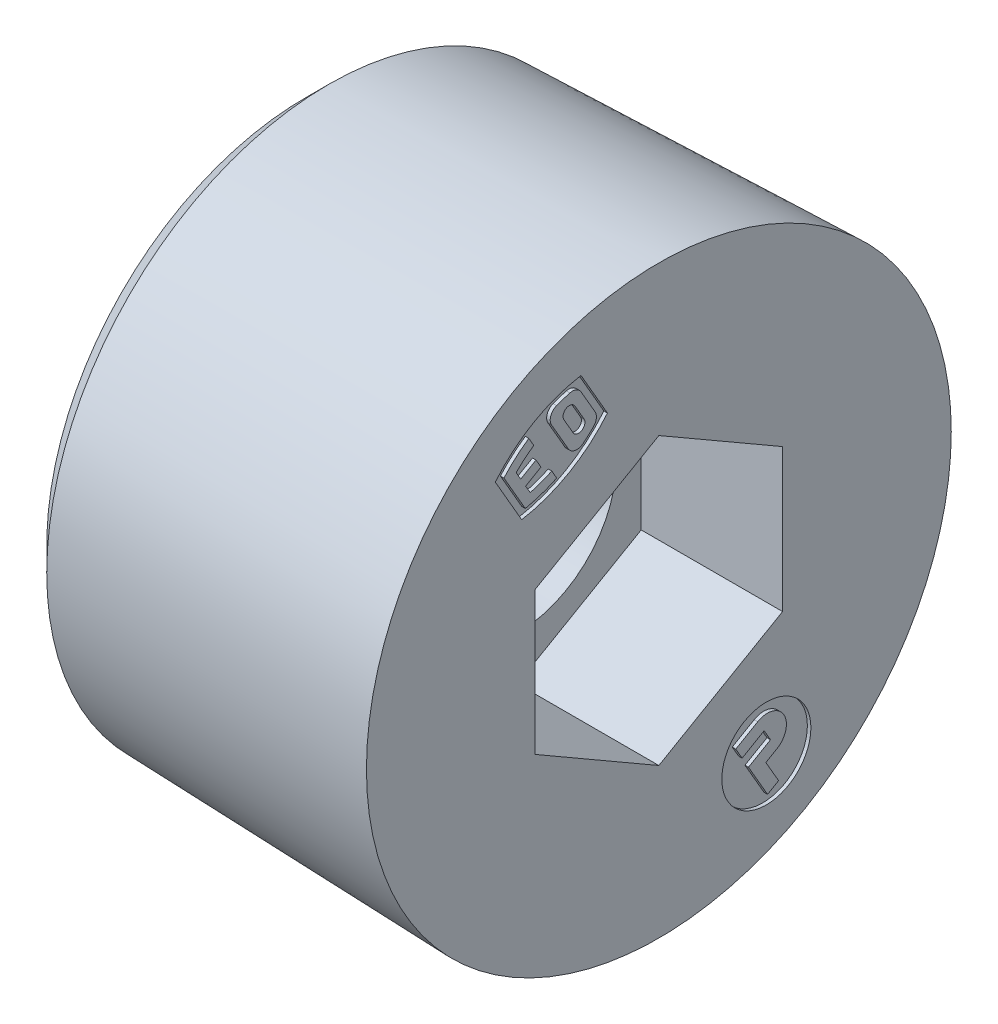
ISO-10303-21;
HEADER;
FILE_DESCRIPTION(('STEP AP214'),'2;1');
FILE_NAME('part.step','',(''),(''),'','','');
FILE_SCHEMA(('AUTOMOTIVE_DESIGN { 1 0 10303 214 1 1 1 1 }'));
ENDSEC;
DATA;
#1=APPLICATION_CONTEXT('core data for automotive mechanical design processes');
#2=APPLICATION_PROTOCOL_DEFINITION('international standard','automotive_design',2000,#1);
#3=PRODUCT_CONTEXT('',#1,'mechanical');
#4=PRODUCT('Part','Part','',(#3));
#5=PRODUCT_RELATED_PRODUCT_CATEGORY('part','',(#4));
#6=PRODUCT_DEFINITION_FORMATION('','',#4);
#7=PRODUCT_DEFINITION_CONTEXT('part definition',#1,'design');
#8=PRODUCT_DEFINITION('design','',#6,#7);
#9=PRODUCT_DEFINITION_SHAPE('','',#8);
#10=(LENGTH_UNIT() NAMED_UNIT(*) SI_UNIT(.MILLI.,.METRE.));
#11=(NAMED_UNIT(*) PLANE_ANGLE_UNIT() SI_UNIT($,.RADIAN.));
#12=(NAMED_UNIT(*) SI_UNIT($,.STERADIAN.) SOLID_ANGLE_UNIT());
#13=UNCERTAINTY_MEASURE_WITH_UNIT(LENGTH_MEASURE(1.E-05),#10,'distance_accuracy_value','');
#14=(GEOMETRIC_REPRESENTATION_CONTEXT(3) GLOBAL_UNCERTAINTY_ASSIGNED_CONTEXT((#13)) GLOBAL_UNIT_ASSIGNED_CONTEXT((#10,
#11,#12)) REPRESENTATION_CONTEXT('',''));
#15=CARTESIAN_POINT('',(0.,0.,0.));
#16=DIRECTION('',(0.,0.,1.));
#17=DIRECTION('',(1.,0.,0.));
#18=AXIS2_PLACEMENT_3D('',#15,#16,#17);
#19=CARTESIAN_POINT('',(0.,-9.67123865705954,-6.1379485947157));
#20=DIRECTION('',(1.,0.,0.));
#21=DIRECTION('',(0.,1.,0.));
#22=AXIS2_PLACEMENT_3D('',#19,#20,#21);
#23=PLANE('',#22);
#24=DIRECTION('',(0.,-0.5,0.866025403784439));
#25=VECTOR('',#24,1.);
#26=CARTESIAN_POINT('',(0.,-8.73593126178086,-5.59794852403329));
#27=LINE('',#26,#25);
#28=CARTESIAN_POINT('',(0.,-8.73593126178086,-5.59794852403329));
#29=VERTEX_POINT('',#28);
#30=CARTESIAN_POINT('',(0.,-9.45593126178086,-4.3508719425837));
#31=VERTEX_POINT('',#30);
#32=EDGE_CURVE('E446',#29,#31,#27,.T.);
#33=ORIENTED_EDGE('',*,*,#32,.T.);
#34=DIRECTION('',(0.,-0.866025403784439,-0.5));
#35=VECTOR('',#34,1.);
#36=CARTESIAN_POINT('',(0.,-9.45593126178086,-4.3508719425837));
#37=LINE('',#36,#35);
#38=CARTESIAN_POINT('',(0.,-10.0794695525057,-4.7108719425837));
#39=VERTEX_POINT('',#38);
#40=EDGE_CURVE('E435',#31,#39,#37,.T.);
#41=ORIENTED_EDGE('',*,*,#40,.T.);
#42=DIRECTION('',(0.,0.5,-0.866025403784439));
#43=VECTOR('',#42,1.);
#44=CARTESIAN_POINT('',(0.,-10.0794695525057,-4.7108719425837));
#45=LINE('',#44,#43);
#46=CARTESIAN_POINT('',(0.,-9.35946955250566,-5.95794852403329));
#47=VERTEX_POINT('',#46);
#48=EDGE_CURVE('E431',#39,#47,#45,.T.);
#49=ORIENTED_EDGE('',*,*,#48,.T.);
#50=DIRECTION('',(0.,-0.866025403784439,-0.5));
#51=VECTOR('',#50,1.);
#52=CARTESIAN_POINT('',(0.,-9.35946955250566,-5.95794852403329));
#53=LINE('',#52,#51);
#54=CARTESIAN_POINT('',(0.,-9.98300784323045,-6.31794852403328));
#55=VERTEX_POINT('',#54);
#56=EDGE_CURVE('E542',#47,#55,#53,.T.);
#57=ORIENTED_EDGE('',*,*,#56,.T.);
#58=DIRECTION('',(0.,-0.5,0.866025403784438));
#59=VECTOR('',#58,1.);
#60=CARTESIAN_POINT('',(0.,-9.98300784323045,-6.31794852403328));
#61=LINE('',#60,#59);
#62=CARTESIAN_POINT('',(0.,-10.7030078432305,-5.07087194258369));
#63=VERTEX_POINT('',#62);
#64=EDGE_CURVE('E541',#55,#63,#61,.T.);
#65=ORIENTED_EDGE('',*,*,#64,.T.);
#66=DIRECTION('',(0.,-0.866025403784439,-0.5));
#67=VECTOR('',#66,1.);
#68=CARTESIAN_POINT('',(0.,-10.7030078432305,-5.07087194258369));
#69=LINE('',#68,#67);
#70=CARTESIAN_POINT('',(0.,-12.5736227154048,-6.1508719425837));
#71=VERTEX_POINT('',#70);
#72=EDGE_CURVE('E887',#63,#71,#69,.T.);
#73=ORIENTED_EDGE('',*,*,#72,.T.);
#74=DIRECTION('',(0.,0.5,-0.866025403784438));
#75=VECTOR('',#74,1.);
#76=CARTESIAN_POINT('',(0.,-12.5736227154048,-6.1508719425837));
#77=LINE('',#76,#75);
#78=CARTESIAN_POINT('',(0.,-12.2136227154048,-6.77441023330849));
#79=VERTEX_POINT('',#78);
#80=EDGE_CURVE('E801',#71,#79,#77,.T.);
#81=ORIENTED_EDGE('',*,*,#80,.T.);
#82=DIRECTION('',(0.,0.866025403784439,0.5));
#83=VECTOR('',#82,1.);
#84=CARTESIAN_POINT('',(0.,-12.2136227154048,-6.77441023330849));
#85=LINE('',#84,#83);
#86=CARTESIAN_POINT('',(0.,-10.9665461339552,-6.05441023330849));
#87=VERTEX_POINT('',#86);
#88=EDGE_CURVE('E883',#79,#87,#85,.T.);
#89=ORIENTED_EDGE('',*,*,#88,.T.);
#90=DIRECTION('',(0.,0.5,-0.866025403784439));
#91=VECTOR('',#90,1.);
#92=CARTESIAN_POINT('',(0.,-10.9665461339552,-6.05441023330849));
#93=LINE('',#92,#91);
#94=CARTESIAN_POINT('',(0.,-10.6065461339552,-6.67794852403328));
#95=VERTEX_POINT('',#94);
#96=EDGE_CURVE('E565',#87,#95,#93,.T.);
#97=ORIENTED_EDGE('',*,*,#96,.T.);
#98=CARTESIAN_POINT('',(0.,-9.67123865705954,-6.1379485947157));
#99=DIRECTION('',(1.,0.,0.));
#100=DIRECTION('',(0.,0.,-1.));
#101=AXIS2_PLACEMENT_3D('',#98,#99,#100);
#102=CIRCLE('',#101,1.08);
#103=EDGE_CURVE('E11',#95,#29,#102,.T.);
#104=ORIENTED_EDGE('',*,*,#103,.T.);
#105=EDGE_LOOP('',(#33,#41,#49,#57,#65,#73,#81,#89,#97,#104));
#106=FACE_BOUND('',#105,.T.);
#107=ADVANCED_FACE('F17',(#106),#23,.T.);
#108=CARTESIAN_POINT('',(-0.2,-9.67123865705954,-6.1379485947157));
#109=DIRECTION('',(-1.,0.,0.));
#110=DIRECTION('',(0.,0.,-1.));
#111=AXIS2_PLACEMENT_3D('',#108,#109,#110);
#112=CYLINDRICAL_SURFACE('',#111,1.08);
#113=ORIENTED_EDGE('',*,*,#103,.F.);
#114=DIRECTION('',(1.,0.,0.));
#115=VECTOR('',#114,1.);
#116=CARTESIAN_POINT('',(-0.2,-10.6065461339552,-6.67794852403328));
#117=LINE('',#116,#115);
#118=CARTESIAN_POINT('',(-0.2,-10.6065461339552,-6.67794852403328));
#119=VERTEX_POINT('',#118);
#120=EDGE_CURVE('E28',#119,#95,#117,.T.);
#121=ORIENTED_EDGE('',*,*,#120,.F.);
#122=CARTESIAN_POINT('',(-0.2,-9.67123865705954,-6.1379485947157));
#123=DIRECTION('',(1.,0.,0.));
#124=DIRECTION('',(0.,0.,-1.));
#125=AXIS2_PLACEMENT_3D('',#122,#123,#124);
#126=CIRCLE('',#125,1.08);
#127=CARTESIAN_POINT('',(-0.2,-8.73593126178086,-5.59794852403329));
#128=VERTEX_POINT('',#127);
#129=EDGE_CURVE('E693',#119,#128,#126,.T.);
#130=ORIENTED_EDGE('',*,*,#129,.T.);
#131=DIRECTION('',(1.,0.,0.));
#132=VECTOR('',#131,1.);
#133=CARTESIAN_POINT('',(-0.2,-8.73593126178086,-5.59794852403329));
#134=LINE('',#133,#132);
#135=EDGE_CURVE('E596',#128,#29,#134,.T.);
#136=ORIENTED_EDGE('',*,*,#135,.T.);
#137=EDGE_LOOP('',(#113,#121,#130,#136));
#138=FACE_BOUND('',#137,.T.);
#139=ADVANCED_FACE('F1005',(#138),#112,.T.);
#140=CARTESIAN_POINT('',(-0.2,-10.9665461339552,-6.05441023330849));
#141=DIRECTION('',(0.,-0.866025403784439,-0.5));
#142=DIRECTION('',(0.,0.5,-0.866025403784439));
#143=AXIS2_PLACEMENT_3D('',#140,#141,#142);
#144=PLANE('',#143);
#145=ORIENTED_EDGE('',*,*,#96,.F.);
#146=DIRECTION('',(1.,0.,0.));
#147=VECTOR('',#146,1.);
#148=CARTESIAN_POINT('',(-0.2,-10.9665461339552,-6.05441023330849));
#149=LINE('',#148,#147);
#150=CARTESIAN_POINT('',(-0.2,-10.9665461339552,-6.05441023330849));
#151=VERTEX_POINT('',#150);
#152=EDGE_CURVE('E569',#151,#87,#149,.T.);
#153=ORIENTED_EDGE('',*,*,#152,.F.);
#154=DIRECTION('',(0.,0.5,-0.866025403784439));
#155=VECTOR('',#154,1.);
#156=CARTESIAN_POINT('',(-0.2,-10.9665461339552,-6.05441023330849));
#157=LINE('',#156,#155);
#158=EDGE_CURVE('E684',#151,#119,#157,.T.);
#159=ORIENTED_EDGE('',*,*,#158,.T.);
#160=ORIENTED_EDGE('',*,*,#120,.T.);
#161=EDGE_LOOP('',(#145,#153,#159,#160));
#162=FACE_BOUND('',#161,.T.);
#163=ADVANCED_FACE('F1003',(#162),#144,.T.);
#164=CARTESIAN_POINT('',(-0.2,-12.2136227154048,-6.77441023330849));
#165=DIRECTION('',(0.,0.5,-0.866025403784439));
#166=DIRECTION('',(-1.,0.,0.));
#167=AXIS2_PLACEMENT_3D('',#164,#165,#166);
#168=PLANE('',#167);
#169=ORIENTED_EDGE('',*,*,#88,.F.);
#170=DIRECTION('',(1.,0.,0.));
#171=VECTOR('',#170,1.);
#172=CARTESIAN_POINT('',(-0.2,-12.2136227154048,-6.77441023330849));
#173=LINE('',#172,#171);
#174=CARTESIAN_POINT('',(-0.2,-12.2136227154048,-6.77441023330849));
#175=VERTEX_POINT('',#174);
#176=EDGE_CURVE('E805',#175,#79,#173,.T.);
#177=ORIENTED_EDGE('',*,*,#176,.F.);
#178=DIRECTION('',(0.,0.866025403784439,0.5));
#179=VECTOR('',#178,1.);
#180=CARTESIAN_POINT('',(-0.2,-12.2136227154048,-6.77441023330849));
#181=LINE('',#180,#179);
#182=EDGE_CURVE('E679',#175,#151,#181,.T.);
#183=ORIENTED_EDGE('',*,*,#182,.T.);
#184=ORIENTED_EDGE('',*,*,#152,.T.);
#185=EDGE_LOOP('',(#169,#177,#183,#184));
#186=FACE_BOUND('',#185,.T.);
#187=ADVANCED_FACE('F1001',(#186),#168,.T.);
#188=CARTESIAN_POINT('',(-0.2,-12.5736227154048,-6.1508719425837));
#189=DIRECTION('',(0.,-0.866025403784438,-0.5));
#190=DIRECTION('',(0.,0.5,-0.866025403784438));
#191=AXIS2_PLACEMENT_3D('',#188,#189,#190);
#192=PLANE('',#191);
#193=ORIENTED_EDGE('',*,*,#80,.F.);
#194=DIRECTION('',(1.,0.,0.));
#195=VECTOR('',#194,1.);
#196=CARTESIAN_POINT('',(-0.2,-12.5736227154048,-6.1508719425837));
#197=LINE('',#196,#195);
#198=CARTESIAN_POINT('',(-0.2,-12.5736227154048,-6.1508719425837));
#199=VERTEX_POINT('',#198);
#200=EDGE_CURVE('E806',#199,#71,#197,.T.);
#201=ORIENTED_EDGE('',*,*,#200,.F.);
#202=DIRECTION('',(0.,0.5,-0.866025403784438));
#203=VECTOR('',#202,1.);
#204=CARTESIAN_POINT('',(-0.2,-12.5736227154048,-6.1508719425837));
#205=LINE('',#204,#203);
#206=EDGE_CURVE('E683',#199,#175,#205,.T.);
#207=ORIENTED_EDGE('',*,*,#206,.T.);
#208=ORIENTED_EDGE('',*,*,#176,.T.);
#209=EDGE_LOOP('',(#193,#201,#207,#208));
#210=FACE_BOUND('',#209,.T.);
#211=ADVANCED_FACE('F999',(#210),#192,.T.);
#212=CARTESIAN_POINT('',(-0.2,-10.7030078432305,-5.07087194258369));
#213=DIRECTION('',(0.,-0.5,0.866025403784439));
#214=DIRECTION('',(-1.,0.,0.));
#215=AXIS2_PLACEMENT_3D('',#212,#213,#214);
#216=PLANE('',#215);
#217=ORIENTED_EDGE('',*,*,#72,.F.);
#218=DIRECTION('',(1.,0.,0.));
#219=VECTOR('',#218,1.);
#220=CARTESIAN_POINT('',(-0.2,-10.7030078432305,-5.07087194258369));
#221=LINE('',#220,#219);
#222=CARTESIAN_POINT('',(-0.2,-10.7030078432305,-5.07087194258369));
#223=VERTEX_POINT('',#222);
#224=EDGE_CURVE('E710',#223,#63,#221,.T.);
#225=ORIENTED_EDGE('',*,*,#224,.F.);
#226=DIRECTION('',(0.,-0.866025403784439,-0.5));
#227=VECTOR('',#226,1.);
#228=CARTESIAN_POINT('',(-0.2,-10.7030078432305,-5.07087194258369));
#229=LINE('',#228,#227);
#230=EDGE_CURVE('E593',#223,#199,#229,.T.);
#231=ORIENTED_EDGE('',*,*,#230,.T.);
#232=ORIENTED_EDGE('',*,*,#200,.T.);
#233=EDGE_LOOP('',(#217,#225,#231,#232));
#234=FACE_BOUND('',#233,.T.);
#235=ADVANCED_FACE('F988',(#234),#216,.T.);
#236=CARTESIAN_POINT('',(-0.2,-9.98300784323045,-6.31794852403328));
#237=DIRECTION('',(0.,0.866025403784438,0.5));
#238=DIRECTION('',(1.,0.,0.));
#239=AXIS2_PLACEMENT_3D('',#236,#237,#238);
#240=PLANE('',#239);
#241=ORIENTED_EDGE('',*,*,#64,.F.);
#242=DIRECTION('',(1.,0.,0.));
#243=VECTOR('',#242,1.);
#244=CARTESIAN_POINT('',(-0.2,-9.98300784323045,-6.31794852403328));
#245=LINE('',#244,#243);
#246=CARTESIAN_POINT('',(-0.2,-9.98300784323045,-6.31794852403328));
#247=VERTEX_POINT('',#246);
#248=EDGE_CURVE('E537',#247,#55,#245,.T.);
#249=ORIENTED_EDGE('',*,*,#248,.F.);
#250=DIRECTION('',(0.,-0.5,0.866025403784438));
#251=VECTOR('',#250,1.);
#252=CARTESIAN_POINT('',(-0.2,-9.98300784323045,-6.31794852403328));
#253=LINE('',#252,#251);
#254=EDGE_CURVE('E459',#247,#223,#253,.T.);
#255=ORIENTED_EDGE('',*,*,#254,.T.);
#256=ORIENTED_EDGE('',*,*,#224,.T.);
#257=EDGE_LOOP('',(#241,#249,#255,#256));
#258=FACE_BOUND('',#257,.T.);
#259=ADVANCED_FACE('F994',(#258),#240,.T.);
#260=CARTESIAN_POINT('',(-0.2,-9.35946955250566,-5.95794852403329));
#261=DIRECTION('',(0.,-0.5,0.866025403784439));
#262=DIRECTION('',(-1.,0.,0.));
#263=AXIS2_PLACEMENT_3D('',#260,#261,#262);
#264=PLANE('',#263);
#265=ORIENTED_EDGE('',*,*,#56,.F.);
#266=DIRECTION('',(1.,0.,0.));
#267=VECTOR('',#266,1.);
#268=CARTESIAN_POINT('',(-0.2,-9.35946955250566,-5.95794852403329));
#269=LINE('',#268,#267);
#270=CARTESIAN_POINT('',(-0.2,-9.35946955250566,-5.95794852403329));
#271=VERTEX_POINT('',#270);
#272=EDGE_CURVE('E725',#271,#47,#269,.T.);
#273=ORIENTED_EDGE('',*,*,#272,.F.);
#274=DIRECTION('',(0.,-0.866025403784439,-0.5));
#275=VECTOR('',#274,1.);
#276=CARTESIAN_POINT('',(-0.2,-9.35946955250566,-5.95794852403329));
#277=LINE('',#276,#275);
#278=EDGE_CURVE('E452',#271,#247,#277,.T.);
#279=ORIENTED_EDGE('',*,*,#278,.T.);
#280=ORIENTED_EDGE('',*,*,#248,.T.);
#281=EDGE_LOOP('',(#265,#273,#279,#280));
#282=FACE_BOUND('',#281,.T.);
#283=ADVANCED_FACE('F996',(#282),#264,.T.);
#284=CARTESIAN_POINT('',(-0.2,-10.0794695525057,-4.7108719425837));
#285=DIRECTION('',(0.,-0.866025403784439,-0.5));
#286=DIRECTION('',(0.,0.5,-0.866025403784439));
#287=AXIS2_PLACEMENT_3D('',#284,#285,#286);
#288=PLANE('',#287);
#289=ORIENTED_EDGE('',*,*,#48,.F.);
#290=DIRECTION('',(1.,0.,0.));
#291=VECTOR('',#290,1.);
#292=CARTESIAN_POINT('',(-0.2,-10.0794695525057,-4.7108719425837));
#293=LINE('',#292,#291);
#294=CARTESIAN_POINT('',(-0.2,-10.0794695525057,-4.7108719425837));
#295=VERTEX_POINT('',#294);
#296=EDGE_CURVE('E423',#295,#39,#293,.T.);
#297=ORIENTED_EDGE('',*,*,#296,.F.);
#298=DIRECTION('',(0.,0.5,-0.866025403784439));
#299=VECTOR('',#298,1.);
#300=CARTESIAN_POINT('',(-0.2,-10.0794695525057,-4.7108719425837));
#301=LINE('',#300,#299);
#302=EDGE_CURVE('E428',#295,#271,#301,.T.);
#303=ORIENTED_EDGE('',*,*,#302,.T.);
#304=ORIENTED_EDGE('',*,*,#272,.T.);
#305=EDGE_LOOP('',(#289,#297,#303,#304));
#306=FACE_BOUND('',#305,.T.);
#307=ADVANCED_FACE('F425',(#306),#288,.T.);
#308=CARTESIAN_POINT('',(-0.2,-9.45593126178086,-4.3508719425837));
#309=DIRECTION('',(0.,-0.5,0.866025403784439));
#310=DIRECTION('',(-1.,0.,0.));
#311=AXIS2_PLACEMENT_3D('',#308,#309,#310);
#312=PLANE('',#311);
#313=ORIENTED_EDGE('',*,*,#40,.F.);
#314=DIRECTION('',(1.,0.,0.));
#315=VECTOR('',#314,1.);
#316=CARTESIAN_POINT('',(-0.2,-9.45593126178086,-4.3508719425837));
#317=LINE('',#316,#315);
#318=CARTESIAN_POINT('',(-0.2,-9.45593126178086,-4.3508719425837));
#319=VERTEX_POINT('',#318);
#320=EDGE_CURVE('E441',#319,#31,#317,.T.);
#321=ORIENTED_EDGE('',*,*,#320,.F.);
#322=DIRECTION('',(0.,-0.866025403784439,-0.5));
#323=VECTOR('',#322,1.);
#324=CARTESIAN_POINT('',(-0.2,-9.45593126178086,-4.3508719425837));
#325=LINE('',#324,#323);
#326=EDGE_CURVE('E438',#319,#295,#325,.T.);
#327=ORIENTED_EDGE('',*,*,#326,.T.);
#328=ORIENTED_EDGE('',*,*,#296,.T.);
#329=EDGE_LOOP('',(#313,#321,#327,#328));
#330=FACE_BOUND('',#329,.T.);
#331=ADVANCED_FACE('F439',(#330),#312,.T.);
#332=CARTESIAN_POINT('',(-0.2,-8.73593126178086,-5.59794852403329));
#333=DIRECTION('',(0.,0.866025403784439,0.5));
#334=DIRECTION('',(1.,0.,0.));
#335=AXIS2_PLACEMENT_3D('',#332,#333,#334);
#336=PLANE('',#335);
#337=ORIENTED_EDGE('',*,*,#32,.F.);
#338=ORIENTED_EDGE('',*,*,#135,.F.);
#339=DIRECTION('',(0.,-0.5,0.866025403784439));
#340=VECTOR('',#339,1.);
#341=CARTESIAN_POINT('',(-0.2,-8.73593126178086,-5.59794852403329));
#342=LINE('',#341,#340);
#343=EDGE_CURVE('E697',#128,#319,#342,.T.);
#344=ORIENTED_EDGE('',*,*,#343,.T.);
#345=ORIENTED_EDGE('',*,*,#320,.T.);
#346=EDGE_LOOP('',(#337,#338,#344,#345));
#347=FACE_BOUND('',#346,.T.);
#348=ADVANCED_FACE('F1008',(#347),#336,.T.);
#349=CARTESIAN_POINT('',(-0.2,-10.5347769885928,-6.08225633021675));
#350=DIRECTION('',(1.,0.,0.));
#351=DIRECTION('',(0.,1.,0.));
#352=AXIS2_PLACEMENT_3D('',#349,#350,#351);
#353=PLANE('',#352);
#354=ORIENTED_EDGE('',*,*,#343,.F.);
#355=ORIENTED_EDGE('',*,*,#129,.F.);
#356=ORIENTED_EDGE('',*,*,#158,.F.);
#357=ORIENTED_EDGE('',*,*,#182,.F.);
#358=ORIENTED_EDGE('',*,*,#206,.F.);
#359=ORIENTED_EDGE('',*,*,#230,.F.);
#360=ORIENTED_EDGE('',*,*,#254,.F.);
#361=ORIENTED_EDGE('',*,*,#278,.F.);
#362=ORIENTED_EDGE('',*,*,#302,.F.);
#363=ORIENTED_EDGE('',*,*,#326,.F.);
#364=EDGE_LOOP('',(#354,#355,#356,#357,#358,#359,#360,#361,#362,#363));
#365=FACE_BOUND('',#364,.T.);
#366=CARTESIAN_POINT('',(-0.2,-10.5347769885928,-6.08225633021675));
#367=DIRECTION('',(1.,0.,0.));
#368=DIRECTION('',(0.,0.,-1.));
#369=AXIS2_PLACEMENT_3D('',#366,#367,#368);
#370=CIRCLE('',#369,2.52);
#371=CARTESIAN_POINT('',(-0.2,-10.5347769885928,-8.60225633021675));
#372=VERTEX_POINT('',#371);
#373=EDGE_CURVE('E796',#372,#372,#370,.T.);
#374=ORIENTED_EDGE('',*,*,#373,.T.);
#375=EDGE_LOOP('',(#374));
#376=FACE_BOUND('',#375,.T.);
#377=ADVANCED_FACE('F448',(#365,#376),#353,.T.);
#378=CARTESIAN_POINT('',(-0.2,-10.5347769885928,-6.08225633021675));
#379=DIRECTION('',(-1.,0.,0.));
#380=DIRECTION('',(0.,0.,-1.));
#381=AXIS2_PLACEMENT_3D('',#378,#379,#380);
#382=CYLINDRICAL_SURFACE('',#381,2.52);
#383=ORIENTED_EDGE('',*,*,#373,.F.);
#384=EDGE_LOOP('',(#383));
#385=FACE_BOUND('',#384,.T.);
#386=CARTESIAN_POINT('',(0.,-10.5347769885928,-6.08225633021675));
#387=DIRECTION('',(1.,0.,0.));
#388=DIRECTION('',(0.,0.,-1.));
#389=AXIS2_PLACEMENT_3D('',#386,#387,#388);
#390=CIRCLE('',#389,2.52);
#391=CARTESIAN_POINT('',(0.,-10.5347769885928,-8.60225633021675));
#392=VERTEX_POINT('',#391);
#393=EDGE_CURVE('E497',#392,#392,#390,.T.);
#394=ORIENTED_EDGE('',*,*,#393,.T.);
#395=EDGE_LOOP('',(#394));
#396=FACE_BOUND('',#395,.T.);
#397=ADVANCED_FACE('F1016',(#385,#396),#382,.F.);
#398=CARTESIAN_POINT('',(-0.2,5.3386245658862,3.08225633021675));
#399=DIRECTION('',(1.,0.,0.));
#400=DIRECTION('',(0.,1.,0.));
#401=AXIS2_PLACEMENT_3D('',#398,#399,#400);
#402=PLANE('',#401);
#403=CARTESIAN_POINT('',(-0.2,10.8244437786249,4.54053873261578));
#404=DIRECTION('',(1.,0.,0.));
#405=DIRECTION('',(0.,0.,-1.));
#406=AXIS2_PLACEMENT_3D('',#403,#404,#405);
#407=CIRCLE('',#406,0.36);
#408=CARTESIAN_POINT('',(-0.2,10.6444437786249,4.85230787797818));
#409=VERTEX_POINT('',#408);
#410=CARTESIAN_POINT('',(-0.2,11.0044437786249,4.22876958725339));
#411=VERTEX_POINT('',#410);
#412=EDGE_CURVE('E479',#409,#411,#407,.T.);
#413=ORIENTED_EDGE('',*,*,#412,.T.);
#414=DIRECTION('',(0.,0.866025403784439,0.5));
#415=VECTOR('',#414,1.);
#416=CARTESIAN_POINT('',(-0.2,11.0044437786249,4.22876958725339));
#417=LINE('',#416,#415);
#418=CARTESIAN_POINT('',(-0.2,11.9051101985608,4.74876958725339));
#419=VERTEX_POINT('',#418);
#420=EDGE_CURVE('E535',#411,#419,#417,.T.);
#421=ORIENTED_EDGE('',*,*,#420,.T.);
#422=CARTESIAN_POINT('',(-0.2,11.7251101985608,5.06053873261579));
#423=DIRECTION('',(1.,0.,0.));
#424=DIRECTION('',(0.,0.,-1.));
#425=AXIS2_PLACEMENT_3D('',#422,#423,#424);
#426=CIRCLE('',#425,0.36);
#427=CARTESIAN_POINT('',(-0.2,11.5451101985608,5.37230787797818));
#428=VERTEX_POINT('',#427);
#429=EDGE_CURVE('E674',#419,#428,#426,.T.);
#430=ORIENTED_EDGE('',*,*,#429,.T.);
#431=DIRECTION('',(0.,-0.866025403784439,-0.5));
#432=VECTOR('',#431,1.);
#433=CARTESIAN_POINT('',(-0.2,11.5451101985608,5.37230787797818));
#434=LINE('',#433,#432);
#435=EDGE_CURVE('E484',#428,#409,#434,.T.);
#436=ORIENTED_EDGE('',*,*,#435,.T.);
#437=EDGE_LOOP('',(#413,#421,#430,#436));
#438=FACE_BOUND('',#437,.T.);
#439=ADVANCED_FACE('F1212',(#438),#402,.T.);
#440=CARTESIAN_POINT('',(0.,5.33862456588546,3.08225633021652));
#441=DIRECTION('',(1.,0.,0.));
#442=DIRECTION('',(0.,1.,0.));
#443=AXIS2_PLACEMENT_3D('',#440,#441,#442);
#444=PLANE('',#443);
#445=DIRECTION('',(0.,0.866025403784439,0.5));
#446=VECTOR('',#445,1.);
#447=CARTESIAN_POINT('',(0.,11.0044437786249,4.22876958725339));
#448=LINE('',#447,#446);
#449=CARTESIAN_POINT('',(0.,11.0044437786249,4.22876958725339));
#450=VERTEX_POINT('',#449);
#451=CARTESIAN_POINT('',(0.,11.9051101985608,4.74876958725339));
#452=VERTEX_POINT('',#451);
#453=EDGE_CURVE('E536',#450,#452,#448,.T.);
#454=ORIENTED_EDGE('',*,*,#453,.F.);
#455=CARTESIAN_POINT('',(0.,10.8244437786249,4.54053873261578));
#456=DIRECTION('',(1.,0.,0.));
#457=DIRECTION('',(0.,0.,-1.));
#458=AXIS2_PLACEMENT_3D('',#455,#456,#457);
#459=CIRCLE('',#458,0.36);
#460=CARTESIAN_POINT('',(0.,10.6444437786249,4.85230787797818));
#461=VERTEX_POINT('',#460);
#462=EDGE_CURVE('E476',#461,#450,#459,.T.);
#463=ORIENTED_EDGE('',*,*,#462,.F.);
#464=DIRECTION('',(0.,-0.866025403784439,-0.5));
#465=VECTOR('',#464,1.);
#466=CARTESIAN_POINT('',(0.,11.5451101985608,5.37230787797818));
#467=LINE('',#466,#465);
#468=CARTESIAN_POINT('',(0.,11.5451101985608,5.37230787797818));
#469=VERTEX_POINT('',#468);
#470=EDGE_CURVE('E481',#469,#461,#467,.T.);
#471=ORIENTED_EDGE('',*,*,#470,.F.);
#472=CARTESIAN_POINT('',(0.,11.7251101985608,5.06053873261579));
#473=DIRECTION('',(1.,0.,0.));
#474=DIRECTION('',(0.,0.,-1.));
#475=AXIS2_PLACEMENT_3D('',#472,#473,#474);
#476=CIRCLE('',#475,0.36);
#477=EDGE_CURVE('E678',#452,#469,#476,.T.);
#478=ORIENTED_EDGE('',*,*,#477,.F.);
#479=EDGE_LOOP('',(#454,#463,#471,#478));
#480=FACE_BOUND('',#479,.T.);
#481=CARTESIAN_POINT('',(0.,5.33862456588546,3.08225633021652));
#482=DIRECTION('',(1.,0.,0.));
#483=DIRECTION('',(0.,0.,-1.));
#484=AXIS2_PLACEMENT_3D('',#481,#482,#483);
#485=CIRCLE('',#484,7.6);
#486=CARTESIAN_POINT('',(0.,12.6848190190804,5.02992854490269));
#487=VERTEX_POINT('',#486);
#488=CARTESIAN_POINT('',(0.,12.4411369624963,5.78675585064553));
#489=VERTEX_POINT('',#488);
#490=EDGE_CURVE('E706',#487,#489,#485,.T.);
#491=ORIENTED_EDGE('',*,*,#490,.T.);
#492=CARTESIAN_POINT('',(0.,11.9177939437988,5.58747693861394));
#493=DIRECTION('',(1.,0.,0.));
#494=DIRECTION('',(0.,0.,-1.));
#495=AXIS2_PLACEMENT_3D('',#492,#493,#494);
#496=CIRCLE('',#495,0.56);
#497=CARTESIAN_POINT('',(0.,11.6377939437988,6.07245116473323));
#498=VERTEX_POINT('',#497);
#499=EDGE_CURVE('E610',#489,#498,#496,.T.);
#500=ORIENTED_EDGE('',*,*,#499,.T.);
#501=DIRECTION('',(0.,-0.866025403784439,-0.5));
#502=VECTOR('',#501,1.);
#503=CARTESIAN_POINT('',(0.,11.6377939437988,6.07245116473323));
#504=LINE('',#503,#502);
#505=CARTESIAN_POINT('',(0.,9.99176003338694,5.12211304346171));
#506=VERTEX_POINT('',#505);
#507=EDGE_CURVE('E635',#498,#506,#504,.T.);
#508=ORIENTED_EDGE('',*,*,#507,.T.);
#509=CARTESIAN_POINT('',(0.,10.2717600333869,4.63713881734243));
#510=DIRECTION('',(1.,0.,0.));
#511=DIRECTION('',(0.,0.,-1.));
#512=AXIS2_PLACEMENT_3D('',#509,#510,#511);
#513=CIRCLE('',#512,0.56);
#514=CARTESIAN_POINT('',(0.,9.83750792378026,4.28354992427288));
#515=VERTEX_POINT('',#514);
#516=EDGE_CURVE('E570',#506,#515,#513,.T.);
#517=ORIENTED_EDGE('',*,*,#516,.T.);
#518=CARTESIAN_POINT('',(0.,15.7309294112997,9.08225633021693));
#519=DIRECTION('',(1.,0.,0.));
#520=DIRECTION('',(0.,0.,-1.));
#521=AXIS2_PLACEMENT_3D('',#518,#519,#520);
#522=CIRCLE('',#521,7.6);
#523=CARTESIAN_POINT('',(0.,10.3710985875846,3.69410140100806));
#524=VERTEX_POINT('',#523);
#525=EDGE_CURVE('E530',#515,#524,#522,.T.);
#526=ORIENTED_EDGE('',*,*,#525,.T.);
#527=CARTESIAN_POINT('',(0.,10.7660334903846,4.09112334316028));
#528=DIRECTION('',(1.,0.,0.));
#529=DIRECTION('',(0.,0.,-1.));
#530=AXIS2_PLACEMENT_3D('',#527,#528,#529);
#531=CIRCLE('',#530,0.56);
#532=CARTESIAN_POINT('',(0.,11.0460334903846,3.60614911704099));
#533=VERTEX_POINT('',#532);
#534=EDGE_CURVE('E529',#524,#533,#531,.T.);
#535=ORIENTED_EDGE('',*,*,#534,.T.);
#536=DIRECTION('',(0.,0.866025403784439,0.5));
#537=VECTOR('',#536,1.);
#538=CARTESIAN_POINT('',(0.,11.0460334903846,3.60614911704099));
#539=LINE('',#538,#537);
#540=CARTESIAN_POINT('',(0.,12.423520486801,4.40144160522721));
#541=VERTEX_POINT('',#540);
#542=EDGE_CURVE('E698',#533,#541,#539,.T.);
#543=ORIENTED_EDGE('',*,*,#542,.T.);
#544=CARTESIAN_POINT('',(0.,12.143520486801,4.8864158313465));
#545=DIRECTION('',(1.,0.,0.));
#546=DIRECTION('',(0.,0.,-1.));
#547=AXIS2_PLACEMENT_3D('',#544,#545,#546);
#548=CIRCLE('',#547,0.56);
#549=EDGE_CURVE('E677',#541,#487,#548,.T.);
#550=ORIENTED_EDGE('',*,*,#549,.T.);
#551=EDGE_LOOP('',(#491,#500,#508,#517,#526,#535,#543,#550));
#552=FACE_BOUND('',#551,.T.);
#553=ADVANCED_FACE('F958',(#480,#552),#444,.T.);
#554=CARTESIAN_POINT('',(-0.2,12.143520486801,4.8864158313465));
#555=DIRECTION('',(-1.,0.,0.));
#556=DIRECTION('',(0.,0.,-1.));
#557=AXIS2_PLACEMENT_3D('',#554,#555,#556);
#558=CYLINDRICAL_SURFACE('',#557,0.56);
#559=ORIENTED_EDGE('',*,*,#549,.F.);
#560=DIRECTION('',(1.,0.,0.));
#561=VECTOR('',#560,1.);
#562=CARTESIAN_POINT('',(-0.2,12.423520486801,4.40144160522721));
#563=LINE('',#562,#561);
#564=CARTESIAN_POINT('',(-0.2,12.423520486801,4.40144160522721));
#565=VERTEX_POINT('',#564);
#566=EDGE_CURVE('E555',#565,#541,#563,.T.);
#567=ORIENTED_EDGE('',*,*,#566,.F.);
#568=CARTESIAN_POINT('',(-0.2,12.143520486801,4.8864158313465));
#569=DIRECTION('',(1.,0.,0.));
#570=DIRECTION('',(0.,0.,-1.));
#571=AXIS2_PLACEMENT_3D('',#568,#569,#570);
#572=CIRCLE('',#571,0.56);
#573=CARTESIAN_POINT('',(-0.2,12.6848190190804,5.02992854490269));
#574=VERTEX_POINT('',#573);
#575=EDGE_CURVE('E634',#565,#574,#572,.T.);
#576=ORIENTED_EDGE('',*,*,#575,.T.);
#577=DIRECTION('',(1.,0.,0.));
#578=VECTOR('',#577,1.);
#579=CARTESIAN_POINT('',(-0.2,12.6848190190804,5.02992854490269));
#580=LINE('',#579,#578);
#581=EDGE_CURVE('E716',#574,#487,#580,.T.);
#582=ORIENTED_EDGE('',*,*,#581,.T.);
#583=EDGE_LOOP('',(#559,#567,#576,#582));
#584=FACE_BOUND('',#583,.T.);
#585=ADVANCED_FACE('F1066',(#584),#558,.T.);
#586=CARTESIAN_POINT('',(-0.2,11.7251101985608,5.06053873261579));
#587=DIRECTION('',(-1.,0.,0.));
#588=DIRECTION('',(0.,0.,-1.));
#589=AXIS2_PLACEMENT_3D('',#586,#587,#588);
#590=CYLINDRICAL_SURFACE('',#589,0.36);
#591=ORIENTED_EDGE('',*,*,#477,.T.);
#592=DIRECTION('',(1.,0.,0.));
#593=VECTOR('',#592,1.);
#594=CARTESIAN_POINT('',(-0.2,11.5451101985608,5.37230787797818));
#595=LINE('',#594,#593);
#596=EDGE_CURVE('E657',#428,#469,#595,.T.);
#597=ORIENTED_EDGE('',*,*,#596,.F.);
#598=ORIENTED_EDGE('',*,*,#429,.F.);
#599=DIRECTION('',(1.,0.,0.));
#600=VECTOR('',#599,1.);
#601=CARTESIAN_POINT('',(-0.2,11.9051101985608,4.74876958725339));
#602=LINE('',#601,#600);
#603=EDGE_CURVE('E531',#419,#452,#602,.T.);
#604=ORIENTED_EDGE('',*,*,#603,.T.);
#605=EDGE_LOOP('',(#591,#597,#598,#604));
#606=FACE_BOUND('',#605,.T.);
#607=ADVANCED_FACE('F1062',(#606),#590,.F.);
#608=CARTESIAN_POINT('',(-0.2,11.5451101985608,5.37230787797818));
#609=DIRECTION('',(0.,-0.5,0.866025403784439));
#610=DIRECTION('',(-1.,0.,0.));
#611=AXIS2_PLACEMENT_3D('',#608,#609,#610);
#612=PLANE('',#611);
#613=ORIENTED_EDGE('',*,*,#470,.T.);
#614=DIRECTION('',(1.,0.,0.));
#615=VECTOR('',#614,1.);
#616=CARTESIAN_POINT('',(-0.2,10.6444437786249,4.85230787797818));
#617=LINE('',#616,#615);
#618=EDGE_CURVE('E485',#409,#461,#617,.T.);
#619=ORIENTED_EDGE('',*,*,#618,.F.);
#620=ORIENTED_EDGE('',*,*,#435,.F.);
#621=ORIENTED_EDGE('',*,*,#596,.T.);
#622=EDGE_LOOP('',(#613,#619,#620,#621));
#623=FACE_BOUND('',#622,.T.);
#624=ADVANCED_FACE('F1065',(#623),#612,.F.);
#625=CARTESIAN_POINT('',(-0.2,10.8244437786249,4.54053873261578));
#626=DIRECTION('',(-1.,0.,0.));
#627=DIRECTION('',(0.,0.,-1.));
#628=AXIS2_PLACEMENT_3D('',#625,#626,#627);
#629=CYLINDRICAL_SURFACE('',#628,0.36);
#630=ORIENTED_EDGE('',*,*,#462,.T.);
#631=DIRECTION('',(1.,0.,0.));
#632=VECTOR('',#631,1.);
#633=CARTESIAN_POINT('',(-0.2,11.0044437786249,4.22876958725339));
#634=LINE('',#633,#632);
#635=EDGE_CURVE('E480',#411,#450,#634,.T.);
#636=ORIENTED_EDGE('',*,*,#635,.F.);
#637=ORIENTED_EDGE('',*,*,#412,.F.);
#638=ORIENTED_EDGE('',*,*,#618,.T.);
#639=EDGE_LOOP('',(#630,#636,#637,#638));
#640=FACE_BOUND('',#639,.T.);
#641=ADVANCED_FACE('F1113',(#640),#629,.F.);
#642=CARTESIAN_POINT('',(-0.2,11.0044437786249,4.22876958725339));
#643=DIRECTION('',(0.,0.5,-0.866025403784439));
#644=DIRECTION('',(-1.,0.,0.));
#645=AXIS2_PLACEMENT_3D('',#642,#643,#644);
#646=PLANE('',#645);
#647=ORIENTED_EDGE('',*,*,#453,.T.);
#648=ORIENTED_EDGE('',*,*,#603,.F.);
#649=ORIENTED_EDGE('',*,*,#420,.F.);
#650=ORIENTED_EDGE('',*,*,#635,.T.);
#651=EDGE_LOOP('',(#647,#648,#649,#650));
#652=FACE_BOUND('',#651,.T.);
#653=ADVANCED_FACE('F1116',(#652),#646,.F.);
#654=CARTESIAN_POINT('',(-0.2,11.0460334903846,3.60614911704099));
#655=DIRECTION('',(0.,0.5,-0.866025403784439));
#656=DIRECTION('',(-1.,0.,0.));
#657=AXIS2_PLACEMENT_3D('',#654,#655,#656);
#658=PLANE('',#657);
#659=ORIENTED_EDGE('',*,*,#542,.F.);
#660=DIRECTION('',(1.,0.,0.));
#661=VECTOR('',#660,1.);
#662=CARTESIAN_POINT('',(-0.2,11.0460334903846,3.60614911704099));
#663=LINE('',#662,#661);
#664=CARTESIAN_POINT('',(-0.2,11.0460334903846,3.60614911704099));
#665=VERTEX_POINT('',#664);
#666=EDGE_CURVE('E600',#665,#533,#663,.T.);
#667=ORIENTED_EDGE('',*,*,#666,.F.);
#668=DIRECTION('',(0.,0.866025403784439,0.5));
#669=VECTOR('',#668,1.);
#670=CARTESIAN_POINT('',(-0.2,11.0460334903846,3.60614911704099));
#671=LINE('',#670,#669);
#672=EDGE_CURVE('E606',#665,#565,#671,.T.);
#673=ORIENTED_EDGE('',*,*,#672,.T.);
#674=ORIENTED_EDGE('',*,*,#566,.T.);
#675=EDGE_LOOP('',(#659,#667,#673,#674));
#676=FACE_BOUND('',#675,.T.);
#677=ADVANCED_FACE('F1124',(#676),#658,.T.);
#678=CARTESIAN_POINT('',(-0.2,10.7660334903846,4.09112334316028));
#679=DIRECTION('',(-1.,0.,0.));
#680=DIRECTION('',(0.,0.,-1.));
#681=AXIS2_PLACEMENT_3D('',#678,#679,#680);
#682=CYLINDRICAL_SURFACE('',#681,0.56);
#683=ORIENTED_EDGE('',*,*,#534,.F.);
#684=DIRECTION('',(1.,0.,0.));
#685=VECTOR('',#684,1.);
#686=CARTESIAN_POINT('',(-0.2,10.3710985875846,3.69410140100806));
#687=LINE('',#686,#685);
#688=CARTESIAN_POINT('',(-0.2,10.3710985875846,3.69410140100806));
#689=VERTEX_POINT('',#688);
#690=EDGE_CURVE('E525',#689,#524,#687,.T.);
#691=ORIENTED_EDGE('',*,*,#690,.F.);
#692=CARTESIAN_POINT('',(-0.2,10.7660334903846,4.09112334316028));
#693=DIRECTION('',(1.,0.,0.));
#694=DIRECTION('',(0.,0.,-1.));
#695=AXIS2_PLACEMENT_3D('',#692,#693,#694);
#696=CIRCLE('',#695,0.56);
#697=EDGE_CURVE('E601',#689,#665,#696,.T.);
#698=ORIENTED_EDGE('',*,*,#697,.T.);
#699=ORIENTED_EDGE('',*,*,#666,.T.);
#700=EDGE_LOOP('',(#683,#691,#698,#699));
#701=FACE_BOUND('',#700,.T.);
#702=ADVANCED_FACE('F1093',(#701),#682,.T.);
#703=CARTESIAN_POINT('',(-0.2,15.7309294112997,9.08225633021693));
#704=DIRECTION('',(-1.,0.,0.));
#705=DIRECTION('',(0.,0.,-1.));
#706=AXIS2_PLACEMENT_3D('',#703,#704,#705);
#707=CYLINDRICAL_SURFACE('',#706,7.6);
#708=ORIENTED_EDGE('',*,*,#525,.F.);
#709=DIRECTION('',(1.,0.,0.));
#710=VECTOR('',#709,1.);
#711=CARTESIAN_POINT('',(-0.2,9.83750792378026,4.28354992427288));
#712=LINE('',#711,#710);
#713=CARTESIAN_POINT('',(-0.2,9.83750792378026,4.28354992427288));
#714=VERTEX_POINT('',#713);
#715=EDGE_CURVE('E564',#714,#515,#712,.T.);
#716=ORIENTED_EDGE('',*,*,#715,.F.);
#717=CARTESIAN_POINT('',(-0.2,15.7309294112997,9.08225633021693));
#718=DIRECTION('',(1.,0.,0.));
#719=DIRECTION('',(0.,0.,-1.));
#720=AXIS2_PLACEMENT_3D('',#717,#718,#719);
#721=CIRCLE('',#720,7.6);
#722=EDGE_CURVE('E605',#714,#689,#721,.T.);
#723=ORIENTED_EDGE('',*,*,#722,.T.);
#724=ORIENTED_EDGE('',*,*,#690,.T.);
#725=EDGE_LOOP('',(#708,#716,#723,#724));
#726=FACE_BOUND('',#725,.T.);
#727=ADVANCED_FACE('F1089',(#726),#707,.T.);
#728=CARTESIAN_POINT('',(-0.2,10.2717600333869,4.63713881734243));
#729=DIRECTION('',(-1.,0.,0.));
#730=DIRECTION('',(0.,0.,-1.));
#731=AXIS2_PLACEMENT_3D('',#728,#729,#730);
#732=CYLINDRICAL_SURFACE('',#731,0.56);
#733=ORIENTED_EDGE('',*,*,#516,.F.);
#734=DIRECTION('',(1.,0.,0.));
#735=VECTOR('',#734,1.);
#736=CARTESIAN_POINT('',(-0.2,9.99176003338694,5.12211304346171));
#737=LINE('',#736,#735);
#738=CARTESIAN_POINT('',(-0.2,9.99176003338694,5.12211304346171));
#739=VERTEX_POINT('',#738);
#740=EDGE_CURVE('E574',#739,#506,#737,.T.);
#741=ORIENTED_EDGE('',*,*,#740,.F.);
#742=CARTESIAN_POINT('',(-0.2,10.2717600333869,4.63713881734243));
#743=DIRECTION('',(1.,0.,0.));
#744=DIRECTION('',(0.,0.,-1.));
#745=AXIS2_PLACEMENT_3D('',#742,#743,#744);
#746=CIRCLE('',#745,0.56);
#747=EDGE_CURVE('E524',#739,#714,#746,.T.);
#748=ORIENTED_EDGE('',*,*,#747,.T.);
#749=ORIENTED_EDGE('',*,*,#715,.T.);
#750=EDGE_LOOP('',(#733,#741,#748,#749));
#751=FACE_BOUND('',#750,.T.);
#752=ADVANCED_FACE('F1092',(#751),#732,.T.);
#753=CARTESIAN_POINT('',(-0.2,11.6377939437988,6.07245116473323));
#754=DIRECTION('',(0.,-0.5,0.866025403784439));
#755=DIRECTION('',(-1.,0.,0.));
#756=AXIS2_PLACEMENT_3D('',#753,#754,#755);
#757=PLANE('',#756);
#758=ORIENTED_EDGE('',*,*,#507,.F.);
#759=DIRECTION('',(1.,0.,0.));
#760=VECTOR('',#759,1.);
#761=CARTESIAN_POINT('',(-0.2,11.6377939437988,6.07245116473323));
#762=LINE('',#761,#760);
#763=CARTESIAN_POINT('',(-0.2,11.6377939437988,6.07245116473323));
#764=VERTEX_POINT('',#763);
#765=EDGE_CURVE('E614',#764,#498,#762,.T.);
#766=ORIENTED_EDGE('',*,*,#765,.F.);
#767=DIRECTION('',(0.,-0.866025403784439,-0.5));
#768=VECTOR('',#767,1.);
#769=CARTESIAN_POINT('',(-0.2,11.6377939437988,6.07245116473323));
#770=LINE('',#769,#768);
#771=EDGE_CURVE('E519',#764,#739,#770,.T.);
#772=ORIENTED_EDGE('',*,*,#771,.T.);
#773=ORIENTED_EDGE('',*,*,#740,.T.);
#774=EDGE_LOOP('',(#758,#766,#772,#773));
#775=FACE_BOUND('',#774,.T.);
#776=ADVANCED_FACE('F1137',(#775),#757,.T.);
#777=CARTESIAN_POINT('',(-0.2,11.9177939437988,5.58747693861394));
#778=DIRECTION('',(-1.,0.,0.));
#779=DIRECTION('',(0.,0.,-1.));
#780=AXIS2_PLACEMENT_3D('',#777,#778,#779);
#781=CYLINDRICAL_SURFACE('',#780,0.56);
#782=ORIENTED_EDGE('',*,*,#499,.F.);
#783=DIRECTION('',(1.,0.,0.));
#784=VECTOR('',#783,1.);
#785=CARTESIAN_POINT('',(-0.2,12.4411369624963,5.78675585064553));
#786=LINE('',#785,#784);
#787=CARTESIAN_POINT('',(-0.2,12.4411369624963,5.78675585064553));
#788=VERTEX_POINT('',#787);
#789=EDGE_CURVE('E615',#788,#489,#786,.T.);
#790=ORIENTED_EDGE('',*,*,#789,.F.);
#791=CARTESIAN_POINT('',(-0.2,11.9177939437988,5.58747693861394));
#792=DIRECTION('',(1.,0.,0.));
#793=DIRECTION('',(0.,0.,-1.));
#794=AXIS2_PLACEMENT_3D('',#791,#792,#793);
#795=CIRCLE('',#794,0.56);
#796=EDGE_CURVE('E523',#788,#764,#795,.T.);
#797=ORIENTED_EDGE('',*,*,#796,.T.);
#798=ORIENTED_EDGE('',*,*,#765,.T.);
#799=EDGE_LOOP('',(#782,#790,#797,#798));
#800=FACE_BOUND('',#799,.T.);
#801=ADVANCED_FACE('F1140',(#800),#781,.T.);
#802=CARTESIAN_POINT('',(-0.2,5.33862456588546,3.08225633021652));
#803=DIRECTION('',(-1.,0.,0.));
#804=DIRECTION('',(0.,0.,-1.));
#805=AXIS2_PLACEMENT_3D('',#802,#803,#804);
#806=CYLINDRICAL_SURFACE('',#805,7.6);
#807=ORIENTED_EDGE('',*,*,#490,.F.);
#808=ORIENTED_EDGE('',*,*,#581,.F.);
#809=CARTESIAN_POINT('',(-0.2,5.33862456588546,3.08225633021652));
#810=DIRECTION('',(1.,0.,0.));
#811=DIRECTION('',(0.,0.,-1.));
#812=AXIS2_PLACEMENT_3D('',#809,#810,#811);
#813=CIRCLE('',#812,7.6);
#814=EDGE_CURVE('E863',#574,#788,#813,.T.);
#815=ORIENTED_EDGE('',*,*,#814,.T.);
#816=ORIENTED_EDGE('',*,*,#789,.T.);
#817=EDGE_LOOP('',(#807,#808,#815,#816));
#818=FACE_BOUND('',#817,.T.);
#819=ADVANCED_FACE('F961',(#818),#806,.T.);
#820=CARTESIAN_POINT('',(0.,5.33862456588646,3.08225633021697));
#821=DIRECTION('',(1.,0.,0.));
#822=DIRECTION('',(0.,1.,0.));
#823=AXIS2_PLACEMENT_3D('',#820,#821,#822);
#824=PLANE('',#823);
#825=CARTESIAN_POINT('',(0.,5.33862456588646,3.08225633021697));
#826=DIRECTION('',(1.,0.,0.));
#827=DIRECTION('',(0.,0.,-1.));
#828=AXIS2_PLACEMENT_3D('',#825,#826,#827);
#829=CIRCLE('',#828,7.6);
#830=CARTESIAN_POINT('',(0.,11.6225258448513,7.35690072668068));
#831=VERTEX_POINT('',#830);
#832=CARTESIAN_POINT('',(0.,10.3836225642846,8.7662685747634));
#833=VERTEX_POINT('',#832);
#834=EDGE_CURVE('E578',#831,#833,#829,.T.);
#835=ORIENTED_EDGE('',*,*,#834,.T.);
#836=DIRECTION('',(0.,-0.866025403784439,-0.5));
#837=VECTOR('',#836,1.);
#838=CARTESIAN_POINT('',(0.,10.3836225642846,8.7662685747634));
#839=LINE('',#838,#837);
#840=CARTESIAN_POINT('',(0.,8.28593141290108,7.55516602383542));
#841=VERTEX_POINT('',#840);
#842=EDGE_CURVE('E518',#833,#841,#839,.T.);
#843=ORIENTED_EDGE('',*,*,#842,.T.);
#844=CARTESIAN_POINT('',(0.,15.7309294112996,9.08225633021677));
#845=DIRECTION('',(1.,0.,0.));
#846=DIRECTION('',(0.,0.,-1.));
#847=AXIS2_PLACEMENT_3D('',#844,#845,#846);
#848=CIRCLE('',#847,7.6);
#849=CARTESIAN_POINT('',(0.,8.88702813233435,5.7775603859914));
#850=VERTEX_POINT('',#849);
#851=EDGE_CURVE('E517',#841,#850,#848,.T.);
#852=ORIENTED_EDGE('',*,*,#851,.T.);
#853=DIRECTION('',(0.,0.866025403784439,0.5));
#854=VECTOR('',#853,1.);
#855=CARTESIAN_POINT('',(0.,8.88702813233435,5.77756038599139));
#856=LINE('',#855,#854);
#857=CARTESIAN_POINT('',(0.,9.37342992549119,6.05838459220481));
#858=VERTEX_POINT('',#857);
#859=EDGE_CURVE('E551',#850,#858,#856,.T.);
#860=ORIENTED_EDGE('',*,*,#859,.T.);
#861=CARTESIAN_POINT('',(0.,15.7309294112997,9.08225633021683));
#862=DIRECTION('',(1.,0.,0.));
#863=DIRECTION('',(0.,0.,-1.));
#864=AXIS2_PLACEMENT_3D('',#861,#862,#863);
#865=CIRCLE('',#864,7.04);
#866=CARTESIAN_POINT('',(0.,8.92603349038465,7.27809682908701));
#867=VERTEX_POINT('',#866);
#868=EDGE_CURVE('E550',#867,#858,#865,.T.);
#869=ORIENTED_EDGE('',*,*,#868,.F.);
#870=DIRECTION('',(0.,0.866025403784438,0.5));
#871=VECTOR('',#870,1.);
#872=CARTESIAN_POINT('',(0.,8.92603349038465,7.27809682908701));
#873=LINE('',#872,#871);
#874=CARTESIAN_POINT('',(0.,9.37228987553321,7.53574307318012));
#875=VERTEX_POINT('',#874);
#876=EDGE_CURVE('E748',#867,#875,#873,.T.);
#877=ORIENTED_EDGE('',*,*,#876,.T.);
#878=DIRECTION('',(0.,0.5,-0.866025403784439));
#879=VECTOR('',#878,1.);
#880=CARTESIAN_POINT('',(0.,9.37228987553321,7.53574307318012));
#881=LINE('',#880,#879);
#882=CARTESIAN_POINT('',(0.,9.8722898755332,6.66971766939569));
#883=VERTEX_POINT('',#882);
#884=EDGE_CURVE('E793',#875,#883,#881,.T.);
#885=ORIENTED_EDGE('',*,*,#884,.T.);
#886=DIRECTION('',(0.,0.866025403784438,0.5));
#887=VECTOR('',#886,1.);
#888=CARTESIAN_POINT('',(0.,9.8722898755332,6.66971766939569));
#889=LINE('',#888,#887);
#890=CARTESIAN_POINT('',(0.,10.3572641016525,6.94971766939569));
#891=VERTEX_POINT('',#890);
#892=EDGE_CURVE('E737',#883,#891,#889,.T.);
#893=ORIENTED_EDGE('',*,*,#892,.T.);
#894=DIRECTION('',(0.,-0.5,0.866025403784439));
#895=VECTOR('',#894,1.);
#896=CARTESIAN_POINT('',(0.,10.3572641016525,6.94971766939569));
#897=LINE('',#896,#895);
#898=CARTESIAN_POINT('',(0.,9.85726410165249,7.81574307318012));
#899=VERTEX_POINT('',#898);
#900=EDGE_CURVE('E486',#891,#899,#897,.T.);
#901=ORIENTED_EDGE('',*,*,#900,.T.);
#902=DIRECTION('',(0.,0.86602540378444,0.5));
#903=VECTOR('',#902,1.);
#904=CARTESIAN_POINT('',(0.,9.85726410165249,7.81574307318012));
#905=LINE('',#904,#903);
#906=CARTESIAN_POINT('',(0.,10.303520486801,8.07338931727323));
#907=VERTEX_POINT('',#906);
#908=EDGE_CURVE('E465',#899,#907,#905,.T.);
#909=ORIENTED_EDGE('',*,*,#908,.T.);
#910=CARTESIAN_POINT('',(0.,5.33862456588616,3.08225633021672));
#911=DIRECTION('',(1.,0.,0.));
#912=DIRECTION('',(0.,0.,-1.));
#913=AXIS2_PLACEMENT_3D('',#910,#911,#912);
#914=CIRCLE('',#913,7.04);
#915=CARTESIAN_POINT('',(0.,11.1361240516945,7.07607652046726));
#916=VERTEX_POINT('',#915);
#917=EDGE_CURVE('E665',#916,#907,#914,.T.);
#918=ORIENTED_EDGE('',*,*,#917,.F.);
#919=DIRECTION('',(0.,0.86602540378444,0.5));
#920=VECTOR('',#919,1.);
#921=CARTESIAN_POINT('',(0.,11.1361240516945,7.07607652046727));
#922=LINE('',#921,#920);
#923=EDGE_CURVE('E664',#916,#831,#922,.T.);
#924=ORIENTED_EDGE('',*,*,#923,.T.);
#925=EDGE_LOOP('',(#835,#843,#852,#860,#869,#877,#885,#893,#901,#909,#918,#924));
#926=FACE_BOUND('',#925,.T.);
#927=ADVANCED_FACE('F925',(#926),#824,.T.);
#928=CARTESIAN_POINT('',(-0.2,11.1361240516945,7.07607652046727));
#929=DIRECTION('',(0.,0.5,-0.86602540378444));
#930=DIRECTION('',(-1.,0.,0.));
#931=AXIS2_PLACEMENT_3D('',#928,#929,#930);
#932=PLANE('',#931);
#933=ORIENTED_EDGE('',*,*,#923,.F.);
#934=DIRECTION('',(1.,0.,0.));
#935=VECTOR('',#934,1.);
#936=CARTESIAN_POINT('',(-0.2,11.1361240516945,7.07607652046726));
#937=LINE('',#936,#935);
#938=CARTESIAN_POINT('',(-0.2,11.1361240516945,7.07607652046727));
#939=VERTEX_POINT('',#938);
#940=EDGE_CURVE('E660',#939,#916,#937,.T.);
#941=ORIENTED_EDGE('',*,*,#940,.F.);
#942=DIRECTION('',(0.,0.86602540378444,0.5));
#943=VECTOR('',#942,1.);
#944=CARTESIAN_POINT('',(-0.2,11.1361240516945,7.07607652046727));
#945=LINE('',#944,#943);
#946=CARTESIAN_POINT('',(-0.2,11.6225258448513,7.35690072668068));
#947=VERTEX_POINT('',#946);
#948=EDGE_CURVE('E841',#939,#947,#945,.T.);
#949=ORIENTED_EDGE('',*,*,#948,.T.);
#950=DIRECTION('',(1.,0.,0.));
#951=VECTOR('',#950,1.);
#952=CARTESIAN_POINT('',(-0.2,11.6225258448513,7.35690072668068));
#953=LINE('',#952,#951);
#954=EDGE_CURVE('E623',#947,#831,#953,.T.);
#955=ORIENTED_EDGE('',*,*,#954,.T.);
#956=EDGE_LOOP('',(#933,#941,#949,#955));
#957=FACE_BOUND('',#956,.T.);
#958=ADVANCED_FACE('F928',(#957),#932,.T.);
#959=CARTESIAN_POINT('',(-0.2,5.33862456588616,3.08225633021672));
#960=DIRECTION('',(-1.,0.,0.));
#961=DIRECTION('',(0.,0.,-1.));
#962=AXIS2_PLACEMENT_3D('',#959,#960,#961);
#963=CYLINDRICAL_SURFACE('',#962,7.04);
#964=ORIENTED_EDGE('',*,*,#917,.T.);
#965=DIRECTION('',(1.,0.,0.));
#966=VECTOR('',#965,1.);
#967=CARTESIAN_POINT('',(-0.2,10.303520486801,8.07338931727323));
#968=LINE('',#967,#966);
#969=CARTESIAN_POINT('',(-0.2,10.303520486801,8.07338931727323));
#970=VERTEX_POINT('',#969);
#971=EDGE_CURVE('E468',#970,#907,#968,.T.);
#972=ORIENTED_EDGE('',*,*,#971,.F.);
#973=CARTESIAN_POINT('',(-0.2,5.33862456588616,3.08225633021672));
#974=DIRECTION('',(1.,0.,0.));
#975=DIRECTION('',(0.,0.,-1.));
#976=AXIS2_PLACEMENT_3D('',#973,#974,#975);
#977=CIRCLE('',#976,7.04);
#978=EDGE_CURVE('E630',#939,#970,#977,.T.);
#979=ORIENTED_EDGE('',*,*,#978,.F.);
#980=ORIENTED_EDGE('',*,*,#940,.T.);
#981=EDGE_LOOP('',(#964,#972,#979,#980));
#982=FACE_BOUND('',#981,.T.);
#983=ADVANCED_FACE('F931',(#982),#963,.F.);
#984=CARTESIAN_POINT('',(-0.2,9.85726410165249,7.81574307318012));
#985=DIRECTION('',(0.,0.5,-0.86602540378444));
#986=DIRECTION('',(-1.,0.,0.));
#987=AXIS2_PLACEMENT_3D('',#984,#985,#986);
#988=PLANE('',#987);
#989=ORIENTED_EDGE('',*,*,#908,.F.);
#990=DIRECTION('',(1.,0.,0.));
#991=VECTOR('',#990,1.);
#992=CARTESIAN_POINT('',(-0.2,9.85726410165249,7.81574307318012));
#993=LINE('',#992,#991);
#994=CARTESIAN_POINT('',(-0.2,9.85726410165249,7.81574307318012));
#995=VERTEX_POINT('',#994);
#996=EDGE_CURVE('E469',#995,#899,#993,.T.);
#997=ORIENTED_EDGE('',*,*,#996,.F.);
#998=DIRECTION('',(0.,0.86602540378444,0.5));
#999=VECTOR('',#998,1.);
#1000=CARTESIAN_POINT('',(-0.2,9.85726410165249,7.81574307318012));
#1001=LINE('',#1000,#999);
#1002=EDGE_CURVE('E625',#995,#970,#1001,.T.);
#1003=ORIENTED_EDGE('',*,*,#1002,.T.);
#1004=ORIENTED_EDGE('',*,*,#971,.T.);
#1005=EDGE_LOOP('',(#989,#997,#1003,#1004));
#1006=FACE_BOUND('',#1005,.T.);
#1007=ADVANCED_FACE('F19',(#1006),#988,.T.);
#1008=CARTESIAN_POINT('',(-0.2,10.3572641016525,6.94971766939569));
#1009=DIRECTION('',(0.,0.866025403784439,0.5));
#1010=DIRECTION('',(1.,0.,0.));
#1011=AXIS2_PLACEMENT_3D('',#1008,#1009,#1010);
#1012=PLANE('',#1011);
#1013=ORIENTED_EDGE('',*,*,#900,.F.);
#1014=DIRECTION('',(1.,0.,0.));
#1015=VECTOR('',#1014,1.);
#1016=CARTESIAN_POINT('',(-0.2,10.3572641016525,6.94971766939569));
#1017=LINE('',#1016,#1015);
#1018=CARTESIAN_POINT('',(-0.2,10.3572641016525,6.94971766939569));
#1019=VERTEX_POINT('',#1018);
#1020=EDGE_CURVE('E490',#1019,#891,#1017,.T.);
#1021=ORIENTED_EDGE('',*,*,#1020,.F.);
#1022=DIRECTION('',(0.,-0.5,0.866025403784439));
#1023=VECTOR('',#1022,1.);
#1024=CARTESIAN_POINT('',(-0.2,10.3572641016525,6.94971766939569));
#1025=LINE('',#1024,#1023);
#1026=EDGE_CURVE('E629',#1019,#995,#1025,.T.);
#1027=ORIENTED_EDGE('',*,*,#1026,.T.);
#1028=ORIENTED_EDGE('',*,*,#996,.T.);
#1029=EDGE_LOOP('',(#1013,#1021,#1027,#1028));
#1030=FACE_BOUND('',#1029,.T.);
#1031=ADVANCED_FACE('F1035',(#1030),#1012,.T.);
#1032=CARTESIAN_POINT('',(-0.2,9.8722898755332,6.66971766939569));
#1033=DIRECTION('',(0.,0.5,-0.866025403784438));
#1034=DIRECTION('',(-1.,0.,0.));
#1035=AXIS2_PLACEMENT_3D('',#1032,#1033,#1034);
#1036=PLANE('',#1035);
#1037=ORIENTED_EDGE('',*,*,#892,.F.);
#1038=DIRECTION('',(1.,0.,0.));
#1039=VECTOR('',#1038,1.);
#1040=CARTESIAN_POINT('',(-0.2,9.8722898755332,6.66971766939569));
#1041=LINE('',#1040,#1039);
#1042=CARTESIAN_POINT('',(-0.2,9.8722898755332,6.66971766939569));
#1043=VERTEX_POINT('',#1042);
#1044=EDGE_CURVE('E854',#1043,#883,#1041,.T.);
#1045=ORIENTED_EDGE('',*,*,#1044,.F.);
#1046=DIRECTION('',(0.,0.866025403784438,0.5));
#1047=VECTOR('',#1046,1.);
#1048=CARTESIAN_POINT('',(-0.2,9.8722898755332,6.66971766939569));
#1049=LINE('',#1048,#1047);
#1050=EDGE_CURVE('E646',#1043,#1019,#1049,.T.);
#1051=ORIENTED_EDGE('',*,*,#1050,.T.);
#1052=ORIENTED_EDGE('',*,*,#1020,.T.);
#1053=EDGE_LOOP('',(#1037,#1045,#1051,#1052));
#1054=FACE_BOUND('',#1053,.T.);
#1055=ADVANCED_FACE('F1038',(#1054),#1036,.T.);
#1056=CARTESIAN_POINT('',(-0.2,9.37228987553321,7.53574307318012));
#1057=DIRECTION('',(0.,-0.866025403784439,-0.5));
#1058=DIRECTION('',(0.,0.5,-0.866025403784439));
#1059=AXIS2_PLACEMENT_3D('',#1056,#1057,#1058);
#1060=PLANE('',#1059);
#1061=ORIENTED_EDGE('',*,*,#884,.F.);
#1062=DIRECTION('',(1.,0.,0.));
#1063=VECTOR('',#1062,1.);
#1064=CARTESIAN_POINT('',(-0.2,9.37228987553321,7.53574307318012));
#1065=LINE('',#1064,#1063);
#1066=CARTESIAN_POINT('',(-0.2,9.37228987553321,7.53574307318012));
#1067=VERTEX_POINT('',#1066);
#1068=EDGE_CURVE('E752',#1067,#875,#1065,.T.);
#1069=ORIENTED_EDGE('',*,*,#1068,.F.);
#1070=DIRECTION('',(0.,0.5,-0.866025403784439));
#1071=VECTOR('',#1070,1.);
#1072=CARTESIAN_POINT('',(-0.2,9.37228987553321,7.53574307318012));
#1073=LINE('',#1072,#1071);
#1074=EDGE_CURVE('E650',#1067,#1043,#1073,.T.);
#1075=ORIENTED_EDGE('',*,*,#1074,.T.);
#1076=ORIENTED_EDGE('',*,*,#1044,.T.);
#1077=EDGE_LOOP('',(#1061,#1069,#1075,#1076));
#1078=FACE_BOUND('',#1077,.T.);
#1079=ADVANCED_FACE('F1087',(#1078),#1060,.T.);
#1080=CARTESIAN_POINT('',(-0.2,8.92603349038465,7.27809682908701));
#1081=DIRECTION('',(0.,0.5,-0.866025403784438));
#1082=DIRECTION('',(-1.,0.,0.));
#1083=AXIS2_PLACEMENT_3D('',#1080,#1081,#1082);
#1084=PLANE('',#1083);
#1085=ORIENTED_EDGE('',*,*,#876,.F.);
#1086=DIRECTION('',(1.,0.,0.));
#1087=VECTOR('',#1086,1.);
#1088=CARTESIAN_POINT('',(-0.2,8.92603349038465,7.27809682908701));
#1089=LINE('',#1088,#1087);
#1090=CARTESIAN_POINT('',(-0.2,8.92603349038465,7.27809682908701));
#1091=VERTEX_POINT('',#1090);
#1092=EDGE_CURVE('E692',#1091,#867,#1089,.T.);
#1093=ORIENTED_EDGE('',*,*,#1092,.F.);
#1094=DIRECTION('',(0.,0.866025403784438,0.5));
#1095=VECTOR('',#1094,1.);
#1096=CARTESIAN_POINT('',(-0.2,8.92603349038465,7.27809682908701));
#1097=LINE('',#1096,#1095);
#1098=EDGE_CURVE('E506',#1091,#1067,#1097,.T.);
#1099=ORIENTED_EDGE('',*,*,#1098,.T.);
#1100=ORIENTED_EDGE('',*,*,#1068,.T.);
#1101=EDGE_LOOP('',(#1085,#1093,#1099,#1100));
#1102=FACE_BOUND('',#1101,.T.);
#1103=ADVANCED_FACE('F1083',(#1102),#1084,.T.);
#1104=CARTESIAN_POINT('',(-0.2,15.7309294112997,9.08225633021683));
#1105=DIRECTION('',(-1.,0.,0.));
#1106=DIRECTION('',(0.,0.,-1.));
#1107=AXIS2_PLACEMENT_3D('',#1104,#1105,#1106);
#1108=CYLINDRICAL_SURFACE('',#1107,7.04);
#1109=ORIENTED_EDGE('',*,*,#868,.T.);
#1110=DIRECTION('',(1.,0.,0.));
#1111=VECTOR('',#1110,1.);
#1112=CARTESIAN_POINT('',(-0.2,9.37342992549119,6.05838459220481));
#1113=LINE('',#1112,#1111);
#1114=CARTESIAN_POINT('',(-0.2,9.37342992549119,6.05838459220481));
#1115=VERTEX_POINT('',#1114);
#1116=EDGE_CURVE('E546',#1115,#858,#1113,.T.);
#1117=ORIENTED_EDGE('',*,*,#1116,.F.);
#1118=CARTESIAN_POINT('',(-0.2,15.7309294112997,9.08225633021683));
#1119=DIRECTION('',(1.,0.,0.));
#1120=DIRECTION('',(0.,0.,-1.));
#1121=AXIS2_PLACEMENT_3D('',#1118,#1119,#1120);
#1122=CIRCLE('',#1121,7.04);
#1123=EDGE_CURVE('E502',#1091,#1115,#1122,.T.);
#1124=ORIENTED_EDGE('',*,*,#1123,.F.);
#1125=ORIENTED_EDGE('',*,*,#1092,.T.);
#1126=EDGE_LOOP('',(#1109,#1117,#1124,#1125));
#1127=FACE_BOUND('',#1126,.T.);
#1128=ADVANCED_FACE('F1079',(#1127),#1108,.F.);
#1129=CARTESIAN_POINT('',(-0.2,8.88702813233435,5.77756038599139));
#1130=DIRECTION('',(0.,0.5,-0.866025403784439));
#1131=DIRECTION('',(-1.,0.,0.));
#1132=AXIS2_PLACEMENT_3D('',#1129,#1130,#1131);
#1133=PLANE('',#1132);
#1134=ORIENTED_EDGE('',*,*,#859,.F.);
#1135=DIRECTION('',(1.,0.,0.));
#1136=VECTOR('',#1135,1.);
#1137=CARTESIAN_POINT('',(-0.2,8.88702813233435,5.7775603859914));
#1138=LINE('',#1137,#1136);
#1139=CARTESIAN_POINT('',(-0.2,8.88702813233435,5.77756038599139));
#1140=VERTEX_POINT('',#1139);
#1141=EDGE_CURVE('E755',#1140,#850,#1138,.T.);
#1142=ORIENTED_EDGE('',*,*,#1141,.F.);
#1143=DIRECTION('',(0.,0.866025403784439,0.5));
#1144=VECTOR('',#1143,1.);
#1145=CARTESIAN_POINT('',(-0.2,8.88702813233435,5.77756038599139));
#1146=LINE('',#1145,#1144);
#1147=EDGE_CURVE('E496',#1140,#1115,#1146,.T.);
#1148=ORIENTED_EDGE('',*,*,#1147,.T.);
#1149=ORIENTED_EDGE('',*,*,#1116,.T.);
#1150=EDGE_LOOP('',(#1134,#1142,#1148,#1149));
#1151=FACE_BOUND('',#1150,.T.);
#1152=ADVANCED_FACE('F1082',(#1151),#1133,.T.);
#1153=CARTESIAN_POINT('',(-0.2,15.7309294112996,9.08225633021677));
#1154=DIRECTION('',(-1.,0.,0.));
#1155=DIRECTION('',(0.,0.,-1.));
#1156=AXIS2_PLACEMENT_3D('',#1153,#1154,#1155);
#1157=CYLINDRICAL_SURFACE('',#1156,7.6);
#1158=ORIENTED_EDGE('',*,*,#851,.F.);
#1159=DIRECTION('',(1.,0.,0.));
#1160=VECTOR('',#1159,1.);
#1161=CARTESIAN_POINT('',(-0.2,8.28593141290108,7.55516602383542));
#1162=LINE('',#1161,#1160);
#1163=CARTESIAN_POINT('',(-0.2,8.28593141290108,7.55516602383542));
#1164=VERTEX_POINT('',#1163);
#1165=EDGE_CURVE('E513',#1164,#841,#1162,.T.);
#1166=ORIENTED_EDGE('',*,*,#1165,.F.);
#1167=CARTESIAN_POINT('',(-0.2,15.7309294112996,9.08225633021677));
#1168=DIRECTION('',(1.,0.,0.));
#1169=DIRECTION('',(0.,0.,-1.));
#1170=AXIS2_PLACEMENT_3D('',#1167,#1168,#1169);
#1171=CIRCLE('',#1170,7.6);
#1172=EDGE_CURVE('E491',#1164,#1140,#1171,.T.);
#1173=ORIENTED_EDGE('',*,*,#1172,.T.);
#1174=ORIENTED_EDGE('',*,*,#1141,.T.);
#1175=EDGE_LOOP('',(#1158,#1166,#1173,#1174));
#1176=FACE_BOUND('',#1175,.T.);
#1177=ADVANCED_FACE('F1102',(#1176),#1157,.T.);
#1178=CARTESIAN_POINT('',(-0.2,10.3836225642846,8.7662685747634));
#1179=DIRECTION('',(0.,-0.5,0.866025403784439));
#1180=DIRECTION('',(-1.,0.,0.));
#1181=AXIS2_PLACEMENT_3D('',#1178,#1179,#1180);
#1182=PLANE('',#1181);
#1183=ORIENTED_EDGE('',*,*,#842,.F.);
#1184=DIRECTION('',(1.,0.,0.));
#1185=VECTOR('',#1184,1.);
#1186=CARTESIAN_POINT('',(-0.2,10.3836225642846,8.7662685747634));
#1187=LINE('',#1186,#1185);
#1188=CARTESIAN_POINT('',(-0.2,10.3836225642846,8.7662685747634));
#1189=VERTEX_POINT('',#1188);
#1190=EDGE_CURVE('E620',#1189,#833,#1187,.T.);
#1191=ORIENTED_EDGE('',*,*,#1190,.F.);
#1192=DIRECTION('',(0.,-0.866025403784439,-0.5));
#1193=VECTOR('',#1192,1.);
#1194=CARTESIAN_POINT('',(-0.2,10.3836225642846,8.7662685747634));
#1195=LINE('',#1194,#1193);
#1196=EDGE_CURVE('E495',#1189,#1164,#1195,.T.);
#1197=ORIENTED_EDGE('',*,*,#1196,.T.);
#1198=ORIENTED_EDGE('',*,*,#1165,.T.);
#1199=EDGE_LOOP('',(#1183,#1191,#1197,#1198));
#1200=FACE_BOUND('',#1199,.T.);
#1201=ADVANCED_FACE('F923',(#1200),#1182,.T.);
#1202=CARTESIAN_POINT('',(-0.2,5.33862456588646,3.08225633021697));
#1203=DIRECTION('',(-1.,0.,0.));
#1204=DIRECTION('',(0.,0.,-1.));
#1205=AXIS2_PLACEMENT_3D('',#1202,#1203,#1204);
#1206=CYLINDRICAL_SURFACE('',#1205,7.6);
#1207=ORIENTED_EDGE('',*,*,#834,.F.);
#1208=ORIENTED_EDGE('',*,*,#954,.F.);
#1209=CARTESIAN_POINT('',(-0.2,5.33862456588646,3.08225633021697));
#1210=DIRECTION('',(1.,0.,0.));
#1211=DIRECTION('',(0.,0.,-1.));
#1212=AXIS2_PLACEMENT_3D('',#1209,#1210,#1211);
#1213=CIRCLE('',#1212,7.6);
#1214=EDGE_CURVE('E845',#947,#1189,#1213,.T.);
#1215=ORIENTED_EDGE('',*,*,#1214,.T.);
#1216=ORIENTED_EDGE('',*,*,#1190,.T.);
#1217=EDGE_LOOP('',(#1207,#1208,#1215,#1216));
#1218=FACE_BOUND('',#1217,.T.);
#1219=ADVANCED_FACE('F913',(#1218),#1206,.T.);
#1220=CARTESIAN_POINT('',(-0.2,5.3386245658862,3.08225633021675));
#1221=DIRECTION('',(1.,0.,0.));
#1222=DIRECTION('',(0.,1.,0.));
#1223=AXIS2_PLACEMENT_3D('',#1220,#1221,#1222);
#1224=PLANE('',#1223);
#1225=ORIENTED_EDGE('',*,*,#1214,.F.);
#1226=ORIENTED_EDGE('',*,*,#948,.F.);
#1227=ORIENTED_EDGE('',*,*,#978,.T.);
#1228=ORIENTED_EDGE('',*,*,#1002,.F.);
#1229=ORIENTED_EDGE('',*,*,#1026,.F.);
#1230=ORIENTED_EDGE('',*,*,#1050,.F.);
#1231=ORIENTED_EDGE('',*,*,#1074,.F.);
#1232=ORIENTED_EDGE('',*,*,#1098,.F.);
#1233=ORIENTED_EDGE('',*,*,#1123,.T.);
#1234=ORIENTED_EDGE('',*,*,#1147,.F.);
#1235=ORIENTED_EDGE('',*,*,#1172,.F.);
#1236=ORIENTED_EDGE('',*,*,#1196,.F.);
#1237=EDGE_LOOP('',(#1225,#1226,#1227,#1228,#1229,#1230,#1231,#1232,#1233,#1234,#1235,#1236));
#1238=FACE_BOUND('',#1237,.T.);
#1239=ORIENTED_EDGE('',*,*,#814,.F.);
#1240=ORIENTED_EDGE('',*,*,#575,.F.);
#1241=ORIENTED_EDGE('',*,*,#672,.F.);
#1242=ORIENTED_EDGE('',*,*,#697,.F.);
#1243=ORIENTED_EDGE('',*,*,#722,.F.);
#1244=ORIENTED_EDGE('',*,*,#747,.F.);
#1245=ORIENTED_EDGE('',*,*,#771,.F.);
#1246=ORIENTED_EDGE('',*,*,#796,.F.);
#1247=EDGE_LOOP('',(#1239,#1240,#1241,#1242,#1243,#1244,#1245,#1246));
#1248=FACE_BOUND('',#1247,.T.);
#1249=CARTESIAN_POINT('',(-0.2,5.3386245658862,3.08225633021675));
#1250=DIRECTION('',(1.,0.,0.));
#1251=DIRECTION('',(0.,0.,-1.));
#1252=AXIS2_PLACEMENT_3D('',#1249,#1250,#1251);
#1253=CIRCLE('',#1252,8.);
#1254=CARTESIAN_POINT('',(-0.2,13.2286168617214,4.40438399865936));
#1255=VERTEX_POINT('',#1254);
#1256=CARTESIAN_POINT('',(-0.2,10.4286168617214,9.25412625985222));
#1257=VERTEX_POINT('',#1256);
#1258=EDGE_CURVE('E814',#1255,#1257,#1253,.T.);
#1259=ORIENTED_EDGE('',*,*,#1258,.T.);
#1260=DIRECTION('',(0.,-0.866025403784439,-0.5));
#1261=VECTOR('',#1260,1.);
#1262=CARTESIAN_POINT('',(-0.2,10.4286168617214,9.25412625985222));
#1263=LINE('',#1262,#1261);
#1264=CARTESIAN_POINT('',(-0.2,7.8409371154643,7.76012866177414));
#1265=VERTEX_POINT('',#1264);
#1266=EDGE_CURVE('E670',#1257,#1265,#1263,.T.);
#1267=ORIENTED_EDGE('',*,*,#1266,.T.);
#1268=CARTESIAN_POINT('',(-0.2,15.7309294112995,9.08225633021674));
#1269=DIRECTION('',(1.,0.,0.));
#1270=DIRECTION('',(0.,0.,-1.));
#1271=AXIS2_PLACEMENT_3D('',#1268,#1269,#1270);
#1272=CIRCLE('',#1271,8.);
#1273=CARTESIAN_POINT('',(-0.2,10.6409371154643,2.91038640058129));
#1274=VERTEX_POINT('',#1273);
#1275=EDGE_CURVE('E669',#1265,#1274,#1272,.T.);
#1276=ORIENTED_EDGE('',*,*,#1275,.T.);
#1277=DIRECTION('',(0.,0.866025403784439,0.5));
#1278=VECTOR('',#1277,1.);
#1279=CARTESIAN_POINT('',(-0.2,10.6409371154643,2.91038640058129));
#1280=LINE('',#1279,#1278);
#1281=EDGE_CURVE('E772',#1274,#1255,#1280,.T.);
#1282=ORIENTED_EDGE('',*,*,#1281,.T.);
#1283=EDGE_LOOP('',(#1259,#1267,#1276,#1282));
#1284=FACE_BOUND('',#1283,.T.);
#1285=ADVANCED_FACE('F917',(#1238,#1248,#1284),#1224,.T.);
#1286=CARTESIAN_POINT('',(-0.2,10.6409371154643,2.91038640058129));
#1287=DIRECTION('',(0.,0.5,-0.866025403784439));
#1288=DIRECTION('',(-1.,0.,0.));
#1289=AXIS2_PLACEMENT_3D('',#1286,#1287,#1288);
#1290=PLANE('',#1289);
#1291=DIRECTION('',(0.,0.866025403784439,0.5));
#1292=VECTOR('',#1291,1.);
#1293=CARTESIAN_POINT('',(0.,10.6409371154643,2.91038640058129));
#1294=LINE('',#1293,#1292);
#1295=CARTESIAN_POINT('',(0.,10.6409371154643,2.91038640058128));
#1296=VERTEX_POINT('',#1295);
#1297=CARTESIAN_POINT('',(0.,13.2286168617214,4.40438399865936));
#1298=VERTEX_POINT('',#1297);
#1299=EDGE_CURVE('E583',#1296,#1298,#1294,.T.);
#1300=ORIENTED_EDGE('',*,*,#1299,.T.);
#1301=DIRECTION('',(1.,0.,0.));
#1302=VECTOR('',#1301,1.);
#1303=CARTESIAN_POINT('',(-0.2,13.2286168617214,4.40438399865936));
#1304=LINE('',#1303,#1302);
#1305=EDGE_CURVE('E810',#1255,#1298,#1304,.T.);
#1306=ORIENTED_EDGE('',*,*,#1305,.F.);
#1307=ORIENTED_EDGE('',*,*,#1281,.F.);
#1308=DIRECTION('',(1.,0.,0.));
#1309=VECTOR('',#1308,1.);
#1310=CARTESIAN_POINT('',(-0.2,10.6409371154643,2.91038640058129));
#1311=LINE('',#1310,#1309);
#1312=EDGE_CURVE('E666',#1274,#1296,#1311,.T.);
#1313=ORIENTED_EDGE('',*,*,#1312,.T.);
#1314=EDGE_LOOP('',(#1300,#1306,#1307,#1313));
#1315=FACE_BOUND('',#1314,.T.);
#1316=ADVANCED_FACE('F1030',(#1315),#1290,.F.);
#1317=CARTESIAN_POINT('',(-0.2,15.7309294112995,9.08225633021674));
#1318=DIRECTION('',(-1.,0.,0.));
#1319=DIRECTION('',(0.,0.,-1.));
#1320=AXIS2_PLACEMENT_3D('',#1317,#1318,#1319);
#1321=CYLINDRICAL_SURFACE('',#1320,8.);
#1322=CARTESIAN_POINT('',(0.,15.7309294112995,9.08225633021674));
#1323=DIRECTION('',(1.,0.,0.));
#1324=DIRECTION('',(0.,0.,-1.));
#1325=AXIS2_PLACEMENT_3D('',#1322,#1323,#1324);
#1326=CIRCLE('',#1325,8.);
#1327=CARTESIAN_POINT('',(0.,7.8409371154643,7.76012866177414));
#1328=VERTEX_POINT('',#1327);
#1329=EDGE_CURVE('E579',#1328,#1296,#1326,.T.);
#1330=ORIENTED_EDGE('',*,*,#1329,.T.);
#1331=ORIENTED_EDGE('',*,*,#1312,.F.);
#1332=ORIENTED_EDGE('',*,*,#1275,.F.);
#1333=DIRECTION('',(1.,0.,0.));
#1334=VECTOR('',#1333,1.);
#1335=CARTESIAN_POINT('',(-0.2,7.8409371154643,7.76012866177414));
#1336=LINE('',#1335,#1334);
#1337=EDGE_CURVE('E813',#1265,#1328,#1336,.T.);
#1338=ORIENTED_EDGE('',*,*,#1337,.T.);
#1339=EDGE_LOOP('',(#1330,#1331,#1332,#1338));
#1340=FACE_BOUND('',#1339,.T.);
#1341=ADVANCED_FACE('F1033',(#1340),#1321,.F.);
#1342=CARTESIAN_POINT('',(-0.2,10.4286168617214,9.25412625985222));
#1343=DIRECTION('',(0.,-0.5,0.866025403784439));
#1344=DIRECTION('',(-1.,0.,0.));
#1345=AXIS2_PLACEMENT_3D('',#1342,#1343,#1344);
#1346=PLANE('',#1345);
#1347=DIRECTION('',(0.,-0.866025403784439,-0.5));
#1348=VECTOR('',#1347,1.);
#1349=CARTESIAN_POINT('',(0.,10.4286168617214,9.25412625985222));
#1350=LINE('',#1349,#1348);
#1351=CARTESIAN_POINT('',(0.,10.4286168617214,9.25412625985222));
#1352=VERTEX_POINT('',#1351);
#1353=EDGE_CURVE('E500',#1352,#1328,#1350,.T.);
#1354=ORIENTED_EDGE('',*,*,#1353,.T.);
#1355=ORIENTED_EDGE('',*,*,#1337,.F.);
#1356=ORIENTED_EDGE('',*,*,#1266,.F.);
#1357=DIRECTION('',(1.,0.,0.));
#1358=VECTOR('',#1357,1.);
#1359=CARTESIAN_POINT('',(-0.2,10.4286168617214,9.25412625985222));
#1360=LINE('',#1359,#1358);
#1361=EDGE_CURVE('E733',#1257,#1352,#1360,.T.);
#1362=ORIENTED_EDGE('',*,*,#1361,.T.);
#1363=EDGE_LOOP('',(#1354,#1355,#1356,#1362));
#1364=FACE_BOUND('',#1363,.T.);
#1365=ADVANCED_FACE('F1070',(#1364),#1346,.F.);
#1366=CARTESIAN_POINT('',(-0.2,5.3386245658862,3.08225633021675));
#1367=DIRECTION('',(-1.,0.,0.));
#1368=DIRECTION('',(0.,0.,-1.));
#1369=AXIS2_PLACEMENT_3D('',#1366,#1367,#1368);
#1370=CYLINDRICAL_SURFACE('',#1369,8.);
#1371=CARTESIAN_POINT('',(0.,5.3386245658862,3.08225633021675));
#1372=DIRECTION('',(1.,0.,0.));
#1373=DIRECTION('',(0.,0.,-1.));
#1374=AXIS2_PLACEMENT_3D('',#1371,#1372,#1373);
#1375=CIRCLE('',#1374,8.);
#1376=EDGE_CURVE('E654',#1298,#1352,#1375,.T.);
#1377=ORIENTED_EDGE('',*,*,#1376,.T.);
#1378=ORIENTED_EDGE('',*,*,#1361,.F.);
#1379=ORIENTED_EDGE('',*,*,#1258,.F.);
#1380=ORIENTED_EDGE('',*,*,#1305,.T.);
#1381=EDGE_LOOP('',(#1377,#1378,#1379,#1380));
#1382=FACE_BOUND('',#1381,.T.);
#1383=ADVANCED_FACE('F1122',(#1382),#1370,.F.);
#1384=CARTESIAN_POINT('',(-10.,0.,0.));
#1385=DIRECTION('',(1.,0.,0.));
#1386=DIRECTION('',(0.,1.,0.));
#1387=AXIS2_PLACEMENT_3D('',#1384,#1385,#1386);
#1388=PLANE('',#1387);
#1389=CARTESIAN_POINT('',(-10.,0.,0.));
#1390=DIRECTION('',(1.,0.,0.));
#1391=DIRECTION('',(0.,0.,-1.));
#1392=AXIS2_PLACEMENT_3D('',#1389,#1390,#1391);
#1393=CIRCLE('',#1392,5.6);
#1394=CARTESIAN_POINT('',(-10.,0.,-5.6));
#1395=VERTEX_POINT('',#1394);
#1396=EDGE_CURVE('E730',#1395,#1395,#1393,.T.);
#1397=ORIENTED_EDGE('',*,*,#1396,.T.);
#1398=EDGE_LOOP('',(#1397));
#1399=FACE_BOUND('',#1398,.T.);
#1400=ADVANCED_FACE('F1130',(#1399),#1388,.T.);
#1401=CARTESIAN_POINT('',(-10.,0.,0.));
#1402=DIRECTION('',(-1.,0.,0.));
#1403=DIRECTION('',(0.,0.,-1.));
#1404=AXIS2_PLACEMENT_3D('',#1401,#1402,#1403);
#1405=CYLINDRICAL_SURFACE('',#1404,5.6);
#1406=ORIENTED_EDGE('',*,*,#1396,.F.);
#1407=EDGE_LOOP('',(#1406));
#1408=FACE_BOUND('',#1407,.T.);
#1409=CARTESIAN_POINT('',(-8.,0.,0.));
#1410=DIRECTION('',(1.,0.,0.));
#1411=DIRECTION('',(0.,0.,-1.));
#1412=AXIS2_PLACEMENT_3D('',#1409,#1410,#1411);
#1413=CIRCLE('',#1412,5.6);
#1414=CARTESIAN_POINT('',(-8.,0.,-5.6));
#1415=VERTEX_POINT('',#1414);
#1416=EDGE_CURVE('E619',#1415,#1415,#1413,.T.);
#1417=ORIENTED_EDGE('',*,*,#1416,.T.);
#1418=EDGE_LOOP('',(#1417));
#1419=FACE_BOUND('',#1418,.T.);
#1420=ADVANCED_FACE('F1052',(#1408,#1419),#1405,.F.);
#1421=CARTESIAN_POINT('',(-8.,0.,0.));
#1422=DIRECTION('',(1.,0.,0.));
#1423=DIRECTION('',(0.,1.,0.));
#1424=AXIS2_PLACEMENT_3D('',#1421,#1422,#1423);
#1425=PLANE('',#1424);
#1426=ORIENTED_EDGE('',*,*,#1416,.F.);
#1427=EDGE_LOOP('',(#1426));
#1428=FACE_BOUND('',#1427,.T.);
#1429=DIRECTION('',(0.,-1.,0.));
#1430=VECTOR('',#1429,1.);
#1431=CARTESIAN_POINT('',(-8.,4.04145188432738,7.));
#1432=LINE('',#1431,#1430);
#1433=CARTESIAN_POINT('',(-8.,4.04145188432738,7.));
#1434=VERTEX_POINT('',#1433);
#1435=CARTESIAN_POINT('',(-8.,-4.04145188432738,7.));
#1436=VERTEX_POINT('',#1435);
#1437=EDGE_CURVE('E585',#1434,#1436,#1432,.T.);
#1438=ORIENTED_EDGE('',*,*,#1437,.T.);
#1439=DIRECTION('',(0.,-0.5,-0.866025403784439));
#1440=VECTOR('',#1439,1.);
#1441=CARTESIAN_POINT('',(-8.,-4.04145188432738,7.));
#1442=LINE('',#1441,#1440);
#1443=CARTESIAN_POINT('',(-8.,-8.08290376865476,0.));
#1444=VERTEX_POINT('',#1443);
#1445=EDGE_CURVE('E685',#1436,#1444,#1442,.T.);
#1446=ORIENTED_EDGE('',*,*,#1445,.T.);
#1447=DIRECTION('',(0.,0.5,-0.866025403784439));
#1448=VECTOR('',#1447,1.);
#1449=CARTESIAN_POINT('',(-8.,-8.08290376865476,0.));
#1450=LINE('',#1449,#1448);
#1451=CARTESIAN_POINT('',(-8.,-4.04145188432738,-7.));
#1452=VERTEX_POINT('',#1451);
#1453=EDGE_CURVE('E470',#1444,#1452,#1450,.T.);
#1454=ORIENTED_EDGE('',*,*,#1453,.T.);
#1455=DIRECTION('',(0.,1.,0.));
#1456=VECTOR('',#1455,1.);
#1457=CARTESIAN_POINT('',(-8.,-4.04145188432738,-7.));
#1458=LINE('',#1457,#1456);
#1459=CARTESIAN_POINT('',(-8.,4.04145188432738,-7.));
#1460=VERTEX_POINT('',#1459);
#1461=EDGE_CURVE('E206',#1452,#1460,#1458,.T.);
#1462=ORIENTED_EDGE('',*,*,#1461,.T.);
#1463=DIRECTION('',(0.,0.5,0.866025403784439));
#1464=VECTOR('',#1463,1.);
#1465=CARTESIAN_POINT('',(-8.,4.04145188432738,-7.));
#1466=LINE('',#1465,#1464);
#1467=CARTESIAN_POINT('',(-8.,8.08290376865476,0.));
#1468=VERTEX_POINT('',#1467);
#1469=EDGE_CURVE('E190',#1460,#1468,#1466,.T.);
#1470=ORIENTED_EDGE('',*,*,#1469,.T.);
#1471=DIRECTION('',(0.,-0.5,0.866025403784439));
#1472=VECTOR('',#1471,1.);
#1473=CARTESIAN_POINT('',(-8.,8.08290376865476,0.));
#1474=LINE('',#1473,#1472);
#1475=EDGE_CURVE('E616',#1468,#1434,#1474,.T.);
#1476=ORIENTED_EDGE('',*,*,#1475,.T.);
#1477=EDGE_LOOP('',(#1438,#1446,#1454,#1462,#1470,#1476));
#1478=FACE_BOUND('',#1477,.T.);
#1479=ADVANCED_FACE('F1048',(#1428,#1478),#1425,.T.);
#1480=CARTESIAN_POINT('',(-8.,8.08290376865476,0.));
#1481=DIRECTION('',(0.,0.866025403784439,0.5));
#1482=DIRECTION('',(1.,0.,0.));
#1483=AXIS2_PLACEMENT_3D('',#1480,#1481,#1482);
#1484=PLANE('',#1483);
#1485=DIRECTION('',(0.,-0.5,0.866025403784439));
#1486=VECTOR('',#1485,1.);
#1487=CARTESIAN_POINT('',(0.,8.08290376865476,0.));
#1488=LINE('',#1487,#1486);
#1489=CARTESIAN_POINT('',(0.,8.08290376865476,0.));
#1490=VERTEX_POINT('',#1489);
#1491=CARTESIAN_POINT('',(0.,4.04145188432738,7.));
#1492=VERTEX_POINT('',#1491);
#1493=EDGE_CURVE('E556',#1490,#1492,#1488,.T.);
#1494=ORIENTED_EDGE('',*,*,#1493,.T.);
#1495=DIRECTION('',(1.,0.,0.));
#1496=VECTOR('',#1495,1.);
#1497=CARTESIAN_POINT('',(-8.,4.04145188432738,7.));
#1498=LINE('',#1497,#1496);
#1499=EDGE_CURVE('E589',#1434,#1492,#1498,.T.);
#1500=ORIENTED_EDGE('',*,*,#1499,.F.);
#1501=ORIENTED_EDGE('',*,*,#1475,.F.);
#1502=DIRECTION('',(1.,0.,0.));
#1503=VECTOR('',#1502,1.);
#1504=CARTESIAN_POINT('',(-8.,8.08290376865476,0.));
#1505=LINE('',#1504,#1503);
#1506=EDGE_CURVE('E473',#1468,#1490,#1505,.T.);
#1507=ORIENTED_EDGE('',*,*,#1506,.T.);
#1508=EDGE_LOOP('',(#1494,#1500,#1501,#1507));
#1509=FACE_BOUND('',#1508,.T.);
#1510=ADVANCED_FACE('F1051',(#1509),#1484,.F.);
#1511=CARTESIAN_POINT('',(-8.,4.04145188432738,-7.));
#1512=DIRECTION('',(0.,0.866025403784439,-0.5));
#1513=DIRECTION('',(-1.,0.,0.));
#1514=AXIS2_PLACEMENT_3D('',#1511,#1512,#1513);
#1515=PLANE('',#1514);
#1516=DIRECTION('',(0.,0.5,0.866025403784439));
#1517=VECTOR('',#1516,1.);
#1518=CARTESIAN_POINT('',(0.,4.04145188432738,-7.));
#1519=LINE('',#1518,#1517);
#1520=CARTESIAN_POINT('',(0.,4.04145188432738,-7.));
#1521=VERTEX_POINT('',#1520);
#1522=EDGE_CURVE('E512',#1521,#1490,#1519,.T.);
#1523=ORIENTED_EDGE('',*,*,#1522,.T.);
#1524=ORIENTED_EDGE('',*,*,#1506,.F.);
#1525=ORIENTED_EDGE('',*,*,#1469,.F.);
#1526=DIRECTION('',(1.,0.,0.));
#1527=VECTOR('',#1526,1.);
#1528=CARTESIAN_POINT('',(-8.,4.04145188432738,-7.));
#1529=LINE('',#1528,#1527);
#1530=EDGE_CURVE('E21',#1460,#1521,#1529,.T.);
#1531=ORIENTED_EDGE('',*,*,#1530,.T.);
#1532=EDGE_LOOP('',(#1523,#1524,#1525,#1531));
#1533=FACE_BOUND('',#1532,.T.);
#1534=ADVANCED_FACE('F1054',(#1533),#1515,.F.);
#1535=CARTESIAN_POINT('',(-8.,-4.04145188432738,-7.));
#1536=DIRECTION('',(0.,0.,-1.));
#1537=DIRECTION('',(0.,-1.,0.));
#1538=AXIS2_PLACEMENT_3D('',#1535,#1536,#1537);
#1539=PLANE('',#1538);
#1540=DIRECTION('',(0.,1.,0.));
#1541=VECTOR('',#1540,1.);
#1542=CARTESIAN_POINT('',(0.,-4.04145188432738,-7.));
#1543=LINE('',#1542,#1541);
#1544=CARTESIAN_POINT('',(0.,-4.04145188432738,-7.));
#1545=VERTEX_POINT('',#1544);
#1546=EDGE_CURVE('E507',#1545,#1521,#1543,.T.);
#1547=ORIENTED_EDGE('',*,*,#1546,.T.);
#1548=ORIENTED_EDGE('',*,*,#1530,.F.);
#1549=ORIENTED_EDGE('',*,*,#1461,.F.);
#1550=DIRECTION('',(1.,0.,0.));
#1551=VECTOR('',#1550,1.);
#1552=CARTESIAN_POINT('',(-8.,-4.04145188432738,-7.));
#1553=LINE('',#1552,#1551);
#1554=EDGE_CURVE('E463',#1452,#1545,#1553,.T.);
#1555=ORIENTED_EDGE('',*,*,#1554,.T.);
#1556=EDGE_LOOP('',(#1547,#1548,#1549,#1555));
#1557=FACE_BOUND('',#1556,.T.);
#1558=ADVANCED_FACE('F1057',(#1557),#1539,.F.);
#1559=CARTESIAN_POINT('',(-8.,-8.08290376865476,0.));
#1560=DIRECTION('',(0.,-0.866025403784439,-0.5));
#1561=DIRECTION('',(0.,0.5,-0.866025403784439));
#1562=AXIS2_PLACEMENT_3D('',#1559,#1560,#1561);
#1563=PLANE('',#1562);
#1564=DIRECTION('',(0.,0.5,-0.866025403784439));
#1565=VECTOR('',#1564,1.);
#1566=CARTESIAN_POINT('',(0.,-8.08290376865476,0.));
#1567=LINE('',#1566,#1565);
#1568=CARTESIAN_POINT('',(0.,-8.08290376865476,0.));
#1569=VERTEX_POINT('',#1568);
#1570=EDGE_CURVE('E511',#1569,#1545,#1567,.T.);
#1571=ORIENTED_EDGE('',*,*,#1570,.T.);
#1572=ORIENTED_EDGE('',*,*,#1554,.F.);
#1573=ORIENTED_EDGE('',*,*,#1453,.F.);
#1574=DIRECTION('',(1.,0.,0.));
#1575=VECTOR('',#1574,1.);
#1576=CARTESIAN_POINT('',(-8.,-8.08290376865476,0.));
#1577=LINE('',#1576,#1575);
#1578=EDGE_CURVE('E689',#1444,#1569,#1577,.T.);
#1579=ORIENTED_EDGE('',*,*,#1578,.T.);
#1580=EDGE_LOOP('',(#1571,#1572,#1573,#1579));
#1581=FACE_BOUND('',#1580,.T.);
#1582=ADVANCED_FACE('F1095',(#1581),#1563,.F.);
#1583=CARTESIAN_POINT('',(-8.,-4.04145188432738,7.));
#1584=DIRECTION('',(0.,-0.866025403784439,0.5));
#1585=DIRECTION('',(-1.,0.,0.));
#1586=AXIS2_PLACEMENT_3D('',#1583,#1584,#1585);
#1587=PLANE('',#1586);
#1588=DIRECTION('',(0.,-0.5,-0.866025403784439));
#1589=VECTOR('',#1588,1.);
#1590=CARTESIAN_POINT('',(0.,-4.04145188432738,7.));
#1591=LINE('',#1590,#1589);
#1592=CARTESIAN_POINT('',(0.,-4.04145188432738,7.));
#1593=VERTEX_POINT('',#1592);
#1594=EDGE_CURVE('E765',#1593,#1569,#1591,.T.);
#1595=ORIENTED_EDGE('',*,*,#1594,.T.);
#1596=ORIENTED_EDGE('',*,*,#1578,.F.);
#1597=ORIENTED_EDGE('',*,*,#1445,.F.);
#1598=DIRECTION('',(1.,0.,0.));
#1599=VECTOR('',#1598,1.);
#1600=CARTESIAN_POINT('',(-8.,-4.04145188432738,7.));
#1601=LINE('',#1600,#1599);
#1602=EDGE_CURVE('E582',#1436,#1593,#1601,.T.);
#1603=ORIENTED_EDGE('',*,*,#1602,.T.);
#1604=EDGE_LOOP('',(#1595,#1596,#1597,#1603));
#1605=FACE_BOUND('',#1604,.T.);
#1606=ADVANCED_FACE('F1046',(#1605),#1587,.F.);
#1607=CARTESIAN_POINT('',(-8.,4.04145188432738,7.));
#1608=DIRECTION('',(0.,0.,1.));
#1609=DIRECTION('',(1.,0.,0.));
#1610=AXIS2_PLACEMENT_3D('',#1607,#1608,#1609);
#1611=PLANE('',#1610);
#1612=DIRECTION('',(0.,-1.,0.));
#1613=VECTOR('',#1612,1.);
#1614=CARTESIAN_POINT('',(0.,4.04145188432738,7.));
#1615=LINE('',#1614,#1613);
#1616=EDGE_CURVE('E501',#1492,#1593,#1615,.T.);
#1617=ORIENTED_EDGE('',*,*,#1616,.T.);
#1618=ORIENTED_EDGE('',*,*,#1602,.F.);
#1619=ORIENTED_EDGE('',*,*,#1437,.F.);
#1620=ORIENTED_EDGE('',*,*,#1499,.T.);
#1621=EDGE_LOOP('',(#1617,#1618,#1619,#1620));
#1622=FACE_BOUND('',#1621,.T.);
#1623=ADVANCED_FACE('F1042',(#1622),#1611,.F.);
#1624=CARTESIAN_POINT('',(0.,16.5442056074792,0.));
#1625=DIRECTION('',(-1.,0.,0.));
#1626=DIRECTION('',(0.,0.,1.));
#1627=AXIS2_PLACEMENT_3D('',#1624,#1625,#1626);
#1628=PLANE('',#1627);
#1629=ORIENTED_EDGE('',*,*,#1353,.F.);
#1630=ORIENTED_EDGE('',*,*,#1376,.F.);
#1631=ORIENTED_EDGE('',*,*,#1299,.F.);
#1632=ORIENTED_EDGE('',*,*,#1329,.F.);
#1633=EDGE_LOOP('',(#1629,#1630,#1631,#1632));
#1634=FACE_BOUND('',#1633,.T.);
#1635=ORIENTED_EDGE('',*,*,#393,.F.);
#1636=EDGE_LOOP('',(#1635));
#1637=FACE_BOUND('',#1636,.T.);
#1638=ORIENTED_EDGE('',*,*,#1493,.F.);
#1639=ORIENTED_EDGE('',*,*,#1522,.F.);
#1640=ORIENTED_EDGE('',*,*,#1546,.F.);
#1641=ORIENTED_EDGE('',*,*,#1570,.F.);
#1642=ORIENTED_EDGE('',*,*,#1594,.F.);
#1643=ORIENTED_EDGE('',*,*,#1616,.F.);
#1644=EDGE_LOOP('',(#1638,#1639,#1640,#1641,#1642,#1643));
#1645=FACE_BOUND('',#1644,.T.);
#1646=CARTESIAN_POINT('',(0.,0.,0.));
#1647=DIRECTION('',(1.,0.,0.));
#1648=DIRECTION('',(0.,0.,-1.));
#1649=AXIS2_PLACEMENT_3D('',#1646,#1647,#1648);
#1650=CIRCLE('',#1649,16.5442056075);
#1651=CARTESIAN_POINT('',(0.,0.,-16.5442056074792));
#1652=VERTEX_POINT('',#1651);
#1653=EDGE_CURVE('E560',#1652,#1652,#1650,.T.);
#1654=ORIENTED_EDGE('',*,*,#1653,.T.);
#1655=EDGE_LOOP('',(#1654));
#1656=FACE_BOUND('',#1655,.T.);
#1657=ADVANCED_FACE('F1045',(#1634,#1637,#1645,#1656),#1628,.F.);
#1658=CARTESIAN_POINT('',(-18.6711137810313,0.,0.));
#1659=DIRECTION('',(1.,0.,0.));
#1660=DIRECTION('',(0.,0.,-1.));
#1661=AXIS2_PLACEMENT_3D('',#1658,#1659,#1660);
#1662=CONICAL_SURFACE('',#1661,15.9613019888,0.031209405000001);
#1663=CARTESIAN_POINT('',(-18.6711137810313,0.,0.));
#1664=DIRECTION('',(1.,0.,0.));
#1665=DIRECTION('',(0.,0.,-1.));
#1666=AXIS2_PLACEMENT_3D('',#1663,#1664,#1665);
#1667=CIRCLE('',#1666,15.9613019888);
#1668=CARTESIAN_POINT('',(-18.6711137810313,0.,-15.9613019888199));
#1669=VERTEX_POINT('',#1668);
#1670=EDGE_CURVE('E642',#1669,#1669,#1667,.T.);
#1671=ORIENTED_EDGE('',*,*,#1670,.T.);
#1672=EDGE_LOOP('',(#1671));
#1673=FACE_BOUND('',#1672,.T.);
#1674=ORIENTED_EDGE('',*,*,#1653,.F.);
#1675=EDGE_LOOP('',(#1674));
#1676=FACE_BOUND('',#1675,.T.);
#1677=ADVANCED_FACE('F1077',(#1673,#1676),#1662,.T.);
#1678=CARTESIAN_POINT('',(-20.,0.,0.));
#1679=DIRECTION('',(1.,0.,0.));
#1680=DIRECTION('',(0.,1.,0.));
#1681=AXIS2_PLACEMENT_3D('',#1678,#1679,#1680);
#1682=PLANE('',#1681);
#1683=CARTESIAN_POINT('',(-20.,0.,0.));
#1684=DIRECTION('',(1.,0.,0.));
#1685=DIRECTION('',(0.,0.,-1.));
#1686=AXIS2_PLACEMENT_3D('',#1683,#1684,#1685);
#1687=CIRCLE('',#1686,14.6324157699);
#1688=CARTESIAN_POINT('',(-20.,0.,-14.6324157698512));
#1689=VERTEX_POINT('',#1688);
#1690=EDGE_CURVE('E645',#1689,#1689,#1687,.T.);
#1691=ORIENTED_EDGE('',*,*,#1690,.F.);
#1692=EDGE_LOOP('',(#1691));
#1693=FACE_BOUND('',#1692,.T.);
#1694=ADVANCED_FACE('F1111',(#1693),#1682,.F.);
#1695=CARTESIAN_POINT('',(-20.,0.,0.));
#1696=DIRECTION('',(1.,0.,0.));
#1697=DIRECTION('',(0.,0.,-1.));
#1698=AXIS2_PLACEMENT_3D('',#1695,#1696,#1697);
#1699=CONICAL_SURFACE('',#1698,14.6324157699,0.7853981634);
#1700=ORIENTED_EDGE('',*,*,#1690,.T.);
#1701=EDGE_LOOP('',(#1700));
#1702=FACE_BOUND('',#1701,.T.);
#1703=ORIENTED_EDGE('',*,*,#1670,.F.);
#1704=EDGE_LOOP('',(#1703));
#1705=FACE_BOUND('',#1704,.T.);
#1706=ADVANCED_FACE('F1108',(#1702,#1705),#1699,.T.);
#1707=CLOSED_SHELL('',(#107,#139,#163,#187,#211,#235,#259,#283,#307,#331,#348,#377,#397,#439,
#553,#585,#607,#624,#641,#653,#677,#702,#727,#752,#776,#801,#819,#927,#958,#983,#1007,#1031,
#1055,#1079,#1103,#1128,#1152,#1177,#1201,#1219,#1285,#1316,#1341,#1365,#1383,#1400,#1420,#1479,
#1510,#1534,#1558,#1582,#1606,#1623,#1657,#1677,#1694,#1706));
#1708=MANIFOLD_SOLID_BREP('B1',#1707);
#1709=ADVANCED_BREP_SHAPE_REPRESENTATION('',(#18,#1708),#14);
#1710=SHAPE_DEFINITION_REPRESENTATION(#9,#1709);
ENDSEC;
END-ISO-10303-21;
